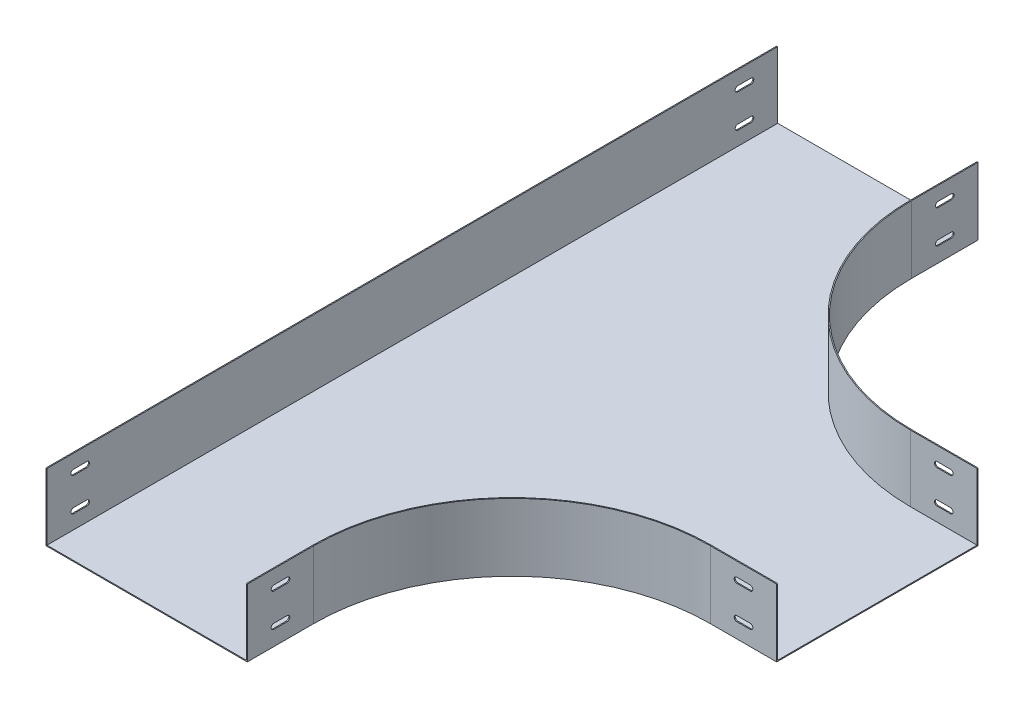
ISO-10303-21;
HEADER;
FILE_DESCRIPTION(('STEP AP214'),'2;1');
FILE_NAME('part.step','',(''),(''),'','','');
FILE_SCHEMA(('AUTOMOTIVE_DESIGN { 1 0 10303 214 1 1 1 1 }'));
ENDSEC;
DATA;
#1=APPLICATION_CONTEXT('core data for automotive mechanical design processes');
#2=APPLICATION_PROTOCOL_DEFINITION('international standard','automotive_design',2000,#1);
#3=PRODUCT_CONTEXT('',#1,'mechanical');
#4=PRODUCT('Part','Part','',(#3));
#5=PRODUCT_RELATED_PRODUCT_CATEGORY('part','',(#4));
#6=PRODUCT_DEFINITION_FORMATION('','',#4);
#7=PRODUCT_DEFINITION_CONTEXT('part definition',#1,'design');
#8=PRODUCT_DEFINITION('design','',#6,#7);
#9=PRODUCT_DEFINITION_SHAPE('','',#8);
#10=(LENGTH_UNIT() NAMED_UNIT(*) SI_UNIT(.MILLI.,.METRE.));
#11=(NAMED_UNIT(*) PLANE_ANGLE_UNIT() SI_UNIT($,.RADIAN.));
#12=(NAMED_UNIT(*) SI_UNIT($,.STERADIAN.) SOLID_ANGLE_UNIT());
#13=UNCERTAINTY_MEASURE_WITH_UNIT(LENGTH_MEASURE(1.E-05),#10,'distance_accuracy_value','');
#14=(GEOMETRIC_REPRESENTATION_CONTEXT(3) GLOBAL_UNCERTAINTY_ASSIGNED_CONTEXT((#13)) GLOBAL_UNIT_ASSIGNED_CONTEXT((#10,
#11,#12)) REPRESENTATION_CONTEXT('',''));
#15=CARTESIAN_POINT('',(0.,0.,0.));
#16=DIRECTION('',(0.,0.,1.));
#17=DIRECTION('',(1.,0.,0.));
#18=AXIS2_PLACEMENT_3D('',#15,#16,#17);
#19=CARTESIAN_POINT('',(-150.,-1.5,-550.));
#20=DIRECTION('',(0.,0.,-1.));
#21=DIRECTION('',(-1.,0.,0.));
#22=AXIS2_PLACEMENT_3D('',#19,#20,#21);
#23=PLANE('',#22);
#24=DIRECTION('',(-1.,0.,0.));
#25=VECTOR('',#24,1.);
#26=CARTESIAN_POINT('',(-150.,0.,-550.));
#27=LINE('',#26,#25);
#28=CARTESIAN_POINT('',(150.,0.,-550.));
#29=VERTEX_POINT('',#28);
#30=CARTESIAN_POINT('',(-150.,0.,-550.));
#31=VERTEX_POINT('',#30);
#32=EDGE_CURVE('E884',#29,#31,#27,.T.);
#33=ORIENTED_EDGE('',*,*,#32,.F.);
#34=DIRECTION('',(0.,-1.,0.));
#35=VECTOR('',#34,1.);
#36=CARTESIAN_POINT('',(150.,100.,-550.));
#37=LINE('',#36,#35);
#38=CARTESIAN_POINT('',(150.,100.,-550.));
#39=VERTEX_POINT('',#38);
#40=EDGE_CURVE('E800',#39,#29,#37,.T.);
#41=ORIENTED_EDGE('',*,*,#40,.F.);
#42=DIRECTION('',(1.,0.,0.));
#43=VECTOR('',#42,1.);
#44=CARTESIAN_POINT('',(150.,100.,-550.));
#45=LINE('',#44,#43);
#46=CARTESIAN_POINT('',(151.5,100.,-550.));
#47=VERTEX_POINT('',#46);
#48=EDGE_CURVE('E766',#39,#47,#45,.T.);
#49=ORIENTED_EDGE('',*,*,#48,.T.);
#50=DIRECTION('',(0.,-1.,0.));
#51=VECTOR('',#50,1.);
#52=CARTESIAN_POINT('',(151.5,100.,-550.));
#53=LINE('',#52,#51);
#54=CARTESIAN_POINT('',(151.5,-1.50000000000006,-550.));
#55=VERTEX_POINT('',#54);
#56=EDGE_CURVE('E802',#47,#55,#53,.T.);
#57=ORIENTED_EDGE('',*,*,#56,.T.);
#58=DIRECTION('',(-1.,0.,0.));
#59=VECTOR('',#58,1.);
#60=CARTESIAN_POINT('',(-150.,-1.5,-550.));
#61=LINE('',#60,#59);
#62=CARTESIAN_POINT('',(-151.5,-1.50000000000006,-550.));
#63=VERTEX_POINT('',#62);
#64=EDGE_CURVE('E886',#55,#63,#61,.T.);
#65=ORIENTED_EDGE('',*,*,#64,.T.);
#66=DIRECTION('',(0.,-1.,0.));
#67=VECTOR('',#66,1.);
#68=CARTESIAN_POINT('',(-151.5,100.,-550.));
#69=LINE('',#68,#67);
#70=CARTESIAN_POINT('',(-151.5,100.,-550.));
#71=VERTEX_POINT('',#70);
#72=EDGE_CURVE('E819',#71,#63,#69,.T.);
#73=ORIENTED_EDGE('',*,*,#72,.F.);
#74=DIRECTION('',(1.,0.,0.));
#75=VECTOR('',#74,1.);
#76=CARTESIAN_POINT('',(-151.5,100.,-550.));
#77=LINE('',#76,#75);
#78=CARTESIAN_POINT('',(-150.,100.,-550.));
#79=VERTEX_POINT('',#78);
#80=EDGE_CURVE('E816',#71,#79,#77,.T.);
#81=ORIENTED_EDGE('',*,*,#80,.T.);
#82=DIRECTION('',(0.,-1.,0.));
#83=VECTOR('',#82,1.);
#84=CARTESIAN_POINT('',(-150.,100.,-550.));
#85=LINE('',#84,#83);
#86=EDGE_CURVE('E822',#79,#31,#85,.T.);
#87=ORIENTED_EDGE('',*,*,#86,.T.);
#88=EDGE_LOOP('',(#33,#41,#49,#57,#65,#73,#81,#87));
#89=FACE_BOUND('',#88,.T.);
#90=ADVANCED_FACE('F32',(#89),#23,.T.);
#91=CARTESIAN_POINT('',(550.,-1.5,-150.));
#92=DIRECTION('',(1.,0.,0.));
#93=DIRECTION('',(0.,0.,-1.));
#94=AXIS2_PLACEMENT_3D('',#91,#92,#93);
#95=PLANE('',#94);
#96=DIRECTION('',(0.,0.,-1.));
#97=VECTOR('',#96,1.);
#98=CARTESIAN_POINT('',(550.,0.,-150.));
#99=LINE('',#98,#97);
#100=CARTESIAN_POINT('',(550.,0.,150.));
#101=VERTEX_POINT('',#100);
#102=CARTESIAN_POINT('',(550.,0.,-150.));
#103=VERTEX_POINT('',#102);
#104=EDGE_CURVE('E1209',#101,#103,#99,.T.);
#105=ORIENTED_EDGE('',*,*,#104,.F.);
#106=DIRECTION('',(0.,1.,0.));
#107=VECTOR('',#106,1.);
#108=CARTESIAN_POINT('',(550.,-1101.5010227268,150.));
#109=LINE('',#108,#107);
#110=CARTESIAN_POINT('',(550.,100.,150.));
#111=VERTEX_POINT('',#110);
#112=EDGE_CURVE('E877',#101,#111,#109,.T.);
#113=ORIENTED_EDGE('',*,*,#112,.T.);
#114=DIRECTION('',(0.,0.,1.));
#115=VECTOR('',#114,1.);
#116=CARTESIAN_POINT('',(550.,100.,150.));
#117=LINE('',#116,#115);
#118=CARTESIAN_POINT('',(550.,100.,151.5));
#119=VERTEX_POINT('',#118);
#120=EDGE_CURVE('E835',#111,#119,#117,.T.);
#121=ORIENTED_EDGE('',*,*,#120,.T.);
#122=DIRECTION('',(0.,1.,0.));
#123=VECTOR('',#122,1.);
#124=CARTESIAN_POINT('',(550.,-1101.5010227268,151.5));
#125=LINE('',#124,#123);
#126=CARTESIAN_POINT('',(550.,-1.50000000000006,151.5));
#127=VERTEX_POINT('',#126);
#128=EDGE_CURVE('E864',#127,#119,#125,.T.);
#129=ORIENTED_EDGE('',*,*,#128,.F.);
#130=DIRECTION('',(0.,0.,-1.));
#131=VECTOR('',#130,1.);
#132=CARTESIAN_POINT('',(550.,-1.5,-150.));
#133=LINE('',#132,#131);
#134=CARTESIAN_POINT('',(550.,-1.50000000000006,-151.5));
#135=VERTEX_POINT('',#134);
#136=EDGE_CURVE('E883',#127,#135,#133,.T.);
#137=ORIENTED_EDGE('',*,*,#136,.T.);
#138=DIRECTION('',(0.,-1.,0.));
#139=VECTOR('',#138,1.);
#140=CARTESIAN_POINT('',(550.,100.,-151.5));
#141=LINE('',#140,#139);
#142=CARTESIAN_POINT('',(550.,100.,-151.5));
#143=VERTEX_POINT('',#142);
#144=EDGE_CURVE('E789',#143,#135,#141,.T.);
#145=ORIENTED_EDGE('',*,*,#144,.F.);
#146=DIRECTION('',(0.,0.,1.));
#147=VECTOR('',#146,1.);
#148=CARTESIAN_POINT('',(550.,100.,-151.5));
#149=LINE('',#148,#147);
#150=CARTESIAN_POINT('',(550.,100.,-150.));
#151=VERTEX_POINT('',#150);
#152=EDGE_CURVE('E778',#143,#151,#149,.T.);
#153=ORIENTED_EDGE('',*,*,#152,.T.);
#154=DIRECTION('',(0.,-1.,0.));
#155=VECTOR('',#154,1.);
#156=CARTESIAN_POINT('',(550.,100.,-150.));
#157=LINE('',#156,#155);
#158=EDGE_CURVE('E792',#151,#103,#157,.T.);
#159=ORIENTED_EDGE('',*,*,#158,.T.);
#160=EDGE_LOOP('',(#105,#113,#121,#129,#137,#145,#153,#159));
#161=FACE_BOUND('',#160,.T.);
#162=ADVANCED_FACE('F987',(#161),#95,.T.);
#163=CARTESIAN_POINT('',(-150.,-1.5,550.));
#164=DIRECTION('',(0.,0.,1.));
#165=DIRECTION('',(1.,0.,0.));
#166=AXIS2_PLACEMENT_3D('',#163,#164,#165);
#167=PLANE('',#166);
#168=DIRECTION('',(1.,0.,0.));
#169=VECTOR('',#168,1.);
#170=CARTESIAN_POINT('',(-150.,0.,550.));
#171=LINE('',#170,#169);
#172=CARTESIAN_POINT('',(-150.,0.,550.));
#173=VERTEX_POINT('',#172);
#174=CARTESIAN_POINT('',(150.,0.,550.));
#175=VERTEX_POINT('',#174);
#176=EDGE_CURVE('E897',#173,#175,#171,.T.);
#177=ORIENTED_EDGE('',*,*,#176,.F.);
#178=DIRECTION('',(0.,-1.,0.));
#179=VECTOR('',#178,1.);
#180=CARTESIAN_POINT('',(-150.,100.,550.));
#181=LINE('',#180,#179);
#182=CARTESIAN_POINT('',(-150.,100.,550.));
#183=VERTEX_POINT('',#182);
#184=EDGE_CURVE('E831',#183,#173,#181,.T.);
#185=ORIENTED_EDGE('',*,*,#184,.F.);
#186=DIRECTION('',(-1.,0.,0.));
#187=VECTOR('',#186,1.);
#188=CARTESIAN_POINT('',(-150.,100.,550.));
#189=LINE('',#188,#187);
#190=CARTESIAN_POINT('',(-151.5,100.,550.));
#191=VERTEX_POINT('',#190);
#192=EDGE_CURVE('E810',#183,#191,#189,.T.);
#193=ORIENTED_EDGE('',*,*,#192,.T.);
#194=DIRECTION('',(0.,-1.,0.));
#195=VECTOR('',#194,1.);
#196=CARTESIAN_POINT('',(-151.5,100.,550.));
#197=LINE('',#196,#195);
#198=CARTESIAN_POINT('',(-151.5,-1.50000000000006,550.));
#199=VERTEX_POINT('',#198);
#200=EDGE_CURVE('E836',#191,#199,#197,.T.);
#201=ORIENTED_EDGE('',*,*,#200,.T.);
#202=DIRECTION('',(1.,0.,0.));
#203=VECTOR('',#202,1.);
#204=CARTESIAN_POINT('',(-150.,-1.5,550.));
#205=LINE('',#204,#203);
#206=CARTESIAN_POINT('',(151.5,-1.50000000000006,550.));
#207=VERTEX_POINT('',#206);
#208=EDGE_CURVE('E881',#199,#207,#205,.T.);
#209=ORIENTED_EDGE('',*,*,#208,.T.);
#210=DIRECTION('',(0.,1.,0.));
#211=VECTOR('',#210,1.);
#212=CARTESIAN_POINT('',(151.5,-1101.5010227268,550.));
#213=LINE('',#212,#211);
#214=CARTESIAN_POINT('',(151.5,100.,550.));
#215=VERTEX_POINT('',#214);
#216=EDGE_CURVE('E869',#207,#215,#213,.T.);
#217=ORIENTED_EDGE('',*,*,#216,.T.);
#218=DIRECTION('',(-1.,0.,0.));
#219=VECTOR('',#218,1.);
#220=CARTESIAN_POINT('',(151.5,100.,550.));
#221=LINE('',#220,#219);
#222=CARTESIAN_POINT('',(150.,100.,550.));
#223=VERTEX_POINT('',#222);
#224=EDGE_CURVE('E848',#215,#223,#221,.T.);
#225=ORIENTED_EDGE('',*,*,#224,.T.);
#226=DIRECTION('',(0.,1.,0.));
#227=VECTOR('',#226,1.);
#228=CARTESIAN_POINT('',(150.,-1101.5010227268,550.));
#229=LINE('',#228,#227);
#230=EDGE_CURVE('E871',#175,#223,#229,.T.);
#231=ORIENTED_EDGE('',*,*,#230,.F.);
#232=EDGE_LOOP('',(#177,#185,#193,#201,#209,#217,#225,#231));
#233=FACE_BOUND('',#232,.T.);
#234=ADVANCED_FACE('F34',(#233),#167,.T.);
#235=CARTESIAN_POINT('',(450.,-1.5,450.));
#236=DIRECTION('',(0.,-1.,0.));
#237=DIRECTION('',(0.,0.,-1.));
#238=AXIS2_PLACEMENT_3D('',#235,#236,#237);
#239=PLANE('',#238);
#240=ORIENTED_EDGE('',*,*,#64,.F.);
#241=DIRECTION('',(0.,0.,-1.));
#242=VECTOR('',#241,1.);
#243=CARTESIAN_POINT('',(151.5,-1.50000000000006,-450.));
#244=LINE('',#243,#242);
#245=CARTESIAN_POINT('',(151.5,-1.50000000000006,-450.));
#246=VERTEX_POINT('',#245);
#247=EDGE_CURVE('E755',#246,#55,#244,.T.);
#248=ORIENTED_EDGE('',*,*,#247,.F.);
#249=CARTESIAN_POINT('',(450.,-1.50000000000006,-450.));
#250=DIRECTION('',(0.,-1.,0.));
#251=DIRECTION('',(0.,0.,-1.));
#252=AXIS2_PLACEMENT_3D('',#249,#250,#251);
#253=CIRCLE('',#252,298.5);
#254=CARTESIAN_POINT('',(450.,-1.50000000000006,-151.5));
#255=VERTEX_POINT('',#254);
#256=EDGE_CURVE('E760',#255,#246,#253,.T.);
#257=ORIENTED_EDGE('',*,*,#256,.F.);
#258=DIRECTION('',(-1.,0.,0.));
#259=VECTOR('',#258,1.);
#260=CARTESIAN_POINT('',(550.,-1.50000000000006,-151.5));
#261=LINE('',#260,#259);
#262=EDGE_CURVE('E756',#135,#255,#261,.T.);
#263=ORIENTED_EDGE('',*,*,#262,.F.);
#264=ORIENTED_EDGE('',*,*,#136,.F.);
#265=DIRECTION('',(1.,0.,0.));
#266=VECTOR('',#265,1.);
#267=CARTESIAN_POINT('',(450.,-1.50000000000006,151.5));
#268=LINE('',#267,#266);
#269=CARTESIAN_POINT('',(450.,-1.50000000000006,151.5));
#270=VERTEX_POINT('',#269);
#271=EDGE_CURVE('E857',#270,#127,#268,.T.);
#272=ORIENTED_EDGE('',*,*,#271,.F.);
#273=CARTESIAN_POINT('',(450.,-1.50000000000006,450.));
#274=DIRECTION('',(0.,-1.,0.));
#275=DIRECTION('',(0.,0.,-1.));
#276=AXIS2_PLACEMENT_3D('',#273,#274,#275);
#277=CIRCLE('',#276,298.5);
#278=CARTESIAN_POINT('',(151.5,-1.50000000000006,450.));
#279=VERTEX_POINT('',#278);
#280=EDGE_CURVE('E862',#279,#270,#277,.T.);
#281=ORIENTED_EDGE('',*,*,#280,.F.);
#282=DIRECTION('',(0.,0.,-1.));
#283=VECTOR('',#282,1.);
#284=CARTESIAN_POINT('',(151.5,-1.50000000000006,550.));
#285=LINE('',#284,#283);
#286=EDGE_CURVE('E858',#207,#279,#285,.T.);
#287=ORIENTED_EDGE('',*,*,#286,.F.);
#288=ORIENTED_EDGE('',*,*,#208,.F.);
#289=DIRECTION('',(0.,0.,1.));
#290=VECTOR('',#289,1.);
#291=CARTESIAN_POINT('',(-151.5,-1.50000000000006,-550.));
#292=LINE('',#291,#290);
#293=EDGE_CURVE('E805',#63,#199,#292,.T.);
#294=ORIENTED_EDGE('',*,*,#293,.F.);
#295=EDGE_LOOP('',(#240,#248,#257,#263,#264,#272,#281,#287,#288,#294));
#296=FACE_BOUND('',#295,.T.);
#297=ADVANCED_FACE('F1000',(#296),#239,.T.);
#298=CARTESIAN_POINT('',(450.,0.,450.));
#299=DIRECTION('',(0.,-1.,0.));
#300=DIRECTION('',(0.,0.,-1.));
#301=AXIS2_PLACEMENT_3D('',#298,#299,#300);
#302=PLANE('',#301);
#303=DIRECTION('',(0.,0.,1.));
#304=VECTOR('',#303,1.);
#305=CARTESIAN_POINT('',(-150.,0.,-550.));
#306=LINE('',#305,#304);
#307=EDGE_CURVE('E879',#31,#173,#306,.T.);
#308=ORIENTED_EDGE('',*,*,#307,.T.);
#309=ORIENTED_EDGE('',*,*,#176,.T.);
#310=DIRECTION('',(0.,0.,-1.));
#311=VECTOR('',#310,1.);
#312=CARTESIAN_POINT('',(150.,0.,550.));
#313=LINE('',#312,#311);
#314=CARTESIAN_POINT('',(150.,0.,450.));
#315=VERTEX_POINT('',#314);
#316=EDGE_CURVE('E891',#175,#315,#313,.T.);
#317=ORIENTED_EDGE('',*,*,#316,.T.);
#318=CARTESIAN_POINT('',(450.,0.,450.));
#319=DIRECTION('',(0.,-1.,0.));
#320=DIRECTION('',(0.,0.,-1.));
#321=AXIS2_PLACEMENT_3D('',#318,#319,#320);
#322=CIRCLE('',#321,300.);
#323=CARTESIAN_POINT('',(450.,0.,150.));
#324=VERTEX_POINT('',#323);
#325=EDGE_CURVE('E1205',#315,#324,#322,.T.);
#326=ORIENTED_EDGE('',*,*,#325,.T.);
#327=DIRECTION('',(1.,0.,0.));
#328=VECTOR('',#327,1.);
#329=CARTESIAN_POINT('',(550.,0.,150.));
#330=LINE('',#329,#328);
#331=EDGE_CURVE('E1207',#324,#101,#330,.T.);
#332=ORIENTED_EDGE('',*,*,#331,.T.);
#333=ORIENTED_EDGE('',*,*,#104,.T.);
#334=DIRECTION('',(-1.,0.,0.));
#335=VECTOR('',#334,1.);
#336=CARTESIAN_POINT('',(550.,0.,-150.));
#337=LINE('',#336,#335);
#338=CARTESIAN_POINT('',(450.,0.,-150.));
#339=VERTEX_POINT('',#338);
#340=EDGE_CURVE('E1201',#103,#339,#337,.T.);
#341=ORIENTED_EDGE('',*,*,#340,.T.);
#342=CARTESIAN_POINT('',(450.,0.,-450.));
#343=DIRECTION('',(0.,-1.,0.));
#344=DIRECTION('',(0.,0.,1.));
#345=AXIS2_PLACEMENT_3D('',#342,#343,#344);
#346=CIRCLE('',#345,300.);
#347=CARTESIAN_POINT('',(150.,0.,-450.));
#348=VERTEX_POINT('',#347);
#349=EDGE_CURVE('E1198',#339,#348,#346,.T.);
#350=ORIENTED_EDGE('',*,*,#349,.T.);
#351=DIRECTION('',(0.,0.,-1.));
#352=VECTOR('',#351,1.);
#353=CARTESIAN_POINT('',(150.,0.,-550.));
#354=LINE('',#353,#352);
#355=EDGE_CURVE('E902',#348,#29,#354,.T.);
#356=ORIENTED_EDGE('',*,*,#355,.T.);
#357=ORIENTED_EDGE('',*,*,#32,.T.);
#358=EDGE_LOOP('',(#308,#309,#317,#326,#332,#333,#341,#350,#356,#357));
#359=FACE_BOUND('',#358,.T.);
#360=ADVANCED_FACE('F996',(#359),#302,.F.);
#361=CARTESIAN_POINT('',(150.,-1101.5010227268,550.));
#362=DIRECTION('',(1.,0.,0.));
#363=DIRECTION('',(0.,0.,-1.));
#364=AXIS2_PLACEMENT_3D('',#361,#362,#363);
#365=PLANE('',#364);
#366=DIRECTION('',(0.,0.,1.));
#367=VECTOR('',#366,1.);
#368=CARTESIAN_POINT('',(150.,28.9999999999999,550.));
#369=LINE('',#368,#367);
#370=CARTESIAN_POINT('',(150.,29.,490.000000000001));
#371=VERTEX_POINT('',#370);
#372=CARTESIAN_POINT('',(150.,29.,510.000000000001));
#373=VERTEX_POINT('',#372);
#374=EDGE_CURVE('E596',#371,#373,#369,.T.);
#375=ORIENTED_EDGE('',*,*,#374,.T.);
#376=CARTESIAN_POINT('',(150.,25.,510.000000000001));
#377=DIRECTION('',(1.,0.,0.));
#378=DIRECTION('',(0.,0.,-1.));
#379=AXIS2_PLACEMENT_3D('',#376,#377,#378);
#380=CIRCLE('',#379,4.);
#381=CARTESIAN_POINT('',(150.,21.,510.000000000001));
#382=VERTEX_POINT('',#381);
#383=EDGE_CURVE('E605',#373,#382,#380,.T.);
#384=ORIENTED_EDGE('',*,*,#383,.T.);
#385=DIRECTION('',(0.,0.,-1.));
#386=VECTOR('',#385,1.);
#387=CARTESIAN_POINT('',(150.,20.9999999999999,550.));
#388=LINE('',#387,#386);
#389=CARTESIAN_POINT('',(150.,20.9999999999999,490.000000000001));
#390=VERTEX_POINT('',#389);
#391=EDGE_CURVE('E582',#382,#390,#388,.T.);
#392=ORIENTED_EDGE('',*,*,#391,.T.);
#393=CARTESIAN_POINT('',(150.,25.,490.000000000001));
#394=DIRECTION('',(1.,0.,0.));
#395=DIRECTION('',(0.,0.,-1.));
#396=AXIS2_PLACEMENT_3D('',#393,#394,#395);
#397=CIRCLE('',#396,4.);
#398=EDGE_CURVE('E589',#390,#371,#397,.T.);
#399=ORIENTED_EDGE('',*,*,#398,.T.);
#400=EDGE_LOOP('',(#375,#384,#392,#399));
#401=FACE_BOUND('',#400,.T.);
#402=DIRECTION('',(0.,0.,1.));
#403=VECTOR('',#402,1.);
#404=CARTESIAN_POINT('',(150.,79.,550.));
#405=LINE('',#404,#403);
#406=CARTESIAN_POINT('',(150.,79.,490.000000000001));
#407=VERTEX_POINT('',#406);
#408=CARTESIAN_POINT('',(150.,79.,510.000000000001));
#409=VERTEX_POINT('',#408);
#410=EDGE_CURVE('E653',#407,#409,#405,.T.);
#411=ORIENTED_EDGE('',*,*,#410,.T.);
#412=CARTESIAN_POINT('',(150.,75.,510.000000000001));
#413=DIRECTION('',(1.,0.,0.));
#414=DIRECTION('',(0.,0.,-1.));
#415=AXIS2_PLACEMENT_3D('',#412,#413,#414);
#416=CIRCLE('',#415,4.);
#417=CARTESIAN_POINT('',(150.,71.,510.000000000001));
#418=VERTEX_POINT('',#417);
#419=EDGE_CURVE('E662',#409,#418,#416,.T.);
#420=ORIENTED_EDGE('',*,*,#419,.T.);
#421=DIRECTION('',(0.,0.,-1.));
#422=VECTOR('',#421,1.);
#423=CARTESIAN_POINT('',(150.,71.,550.));
#424=LINE('',#423,#422);
#425=CARTESIAN_POINT('',(150.,71.,490.000000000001));
#426=VERTEX_POINT('',#425);
#427=EDGE_CURVE('E639',#418,#426,#424,.T.);
#428=ORIENTED_EDGE('',*,*,#427,.T.);
#429=CARTESIAN_POINT('',(150.,75.,490.000000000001));
#430=DIRECTION('',(1.,0.,0.));
#431=DIRECTION('',(0.,0.,-1.));
#432=AXIS2_PLACEMENT_3D('',#429,#430,#431);
#433=CIRCLE('',#432,4.);
#434=EDGE_CURVE('E646',#426,#407,#433,.T.);
#435=ORIENTED_EDGE('',*,*,#434,.T.);
#436=EDGE_LOOP('',(#411,#420,#428,#435));
#437=FACE_BOUND('',#436,.T.);
#438=DIRECTION('',(0.,1.,0.));
#439=VECTOR('',#438,1.);
#440=CARTESIAN_POINT('',(150.,-1101.5010227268,450.));
#441=LINE('',#440,#439);
#442=CARTESIAN_POINT('',(150.,100.,450.));
#443=VERTEX_POINT('',#442);
#444=EDGE_CURVE('E873',#315,#443,#441,.T.);
#445=ORIENTED_EDGE('',*,*,#444,.F.);
#446=ORIENTED_EDGE('',*,*,#316,.F.);
#447=ORIENTED_EDGE('',*,*,#230,.T.);
#448=DIRECTION('',(0.,0.,-1.));
#449=VECTOR('',#448,1.);
#450=CARTESIAN_POINT('',(150.,100.,550.));
#451=LINE('',#450,#449);
#452=EDGE_CURVE('E845',#223,#443,#451,.T.);
#453=ORIENTED_EDGE('',*,*,#452,.T.);
#454=EDGE_LOOP('',(#445,#446,#447,#453));
#455=FACE_BOUND('',#454,.T.);
#456=ADVANCED_FACE('F999',(#401,#437,#455),#365,.F.);
#457=CARTESIAN_POINT('',(450.,-1101.5010227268,450.));
#458=DIRECTION('',(0.,1.,0.));
#459=DIRECTION('',(0.,0.,1.));
#460=AXIS2_PLACEMENT_3D('',#457,#458,#459);
#461=CYLINDRICAL_SURFACE('',#460,300.);
#462=DIRECTION('',(0.,1.,0.));
#463=VECTOR('',#462,1.);
#464=CARTESIAN_POINT('',(450.,-1101.5010227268,150.));
#465=LINE('',#464,#463);
#466=CARTESIAN_POINT('',(450.,100.,150.));
#467=VERTEX_POINT('',#466);
#468=EDGE_CURVE('E875',#324,#467,#465,.T.);
#469=ORIENTED_EDGE('',*,*,#468,.F.);
#470=ORIENTED_EDGE('',*,*,#325,.F.);
#471=ORIENTED_EDGE('',*,*,#444,.T.);
#472=CARTESIAN_POINT('',(450.,100.,450.));
#473=DIRECTION('',(0.,-1.,0.));
#474=DIRECTION('',(0.,0.,1.));
#475=AXIS2_PLACEMENT_3D('',#472,#473,#474);
#476=CIRCLE('',#475,300.);
#477=EDGE_CURVE('E842',#443,#467,#476,.T.);
#478=ORIENTED_EDGE('',*,*,#477,.T.);
#479=EDGE_LOOP('',(#469,#470,#471,#478));
#480=FACE_BOUND('',#479,.T.);
#481=ADVANCED_FACE('F1021',(#480),#461,.T.);
#482=CARTESIAN_POINT('',(450.,-1101.5010227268,150.));
#483=DIRECTION('',(0.,0.,1.));
#484=DIRECTION('',(1.,0.,0.));
#485=AXIS2_PLACEMENT_3D('',#482,#483,#484);
#486=PLANE('',#485);
#487=DIRECTION('',(-1.,0.,0.));
#488=VECTOR('',#487,1.);
#489=CARTESIAN_POINT('',(450.,28.9999999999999,150.));
#490=LINE('',#489,#488);
#491=CARTESIAN_POINT('',(510.,29.,150.));
#492=VERTEX_POINT('',#491);
#493=CARTESIAN_POINT('',(490.,29.,150.));
#494=VERTEX_POINT('',#493);
#495=EDGE_CURVE('E698',#492,#494,#490,.T.);
#496=ORIENTED_EDGE('',*,*,#495,.T.);
#497=CARTESIAN_POINT('',(490.,25.,150.));
#498=DIRECTION('',(0.,0.,1.));
#499=DIRECTION('',(1.,0.,0.));
#500=AXIS2_PLACEMENT_3D('',#497,#498,#499);
#501=CIRCLE('',#500,4.);
#502=CARTESIAN_POINT('',(490.,21.,150.));
#503=VERTEX_POINT('',#502);
#504=EDGE_CURVE('E707',#494,#503,#501,.T.);
#505=ORIENTED_EDGE('',*,*,#504,.T.);
#506=DIRECTION('',(1.,0.,0.));
#507=VECTOR('',#506,1.);
#508=CARTESIAN_POINT('',(450.,20.9999999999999,150.));
#509=LINE('',#508,#507);
#510=CARTESIAN_POINT('',(510.,20.9999999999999,150.));
#511=VERTEX_POINT('',#510);
#512=EDGE_CURVE('E684',#503,#511,#509,.T.);
#513=ORIENTED_EDGE('',*,*,#512,.T.);
#514=CARTESIAN_POINT('',(510.,25.,150.));
#515=DIRECTION('',(0.,0.,1.));
#516=DIRECTION('',(1.,0.,0.));
#517=AXIS2_PLACEMENT_3D('',#514,#515,#516);
#518=CIRCLE('',#517,4.);
#519=EDGE_CURVE('E691',#511,#492,#518,.T.);
#520=ORIENTED_EDGE('',*,*,#519,.T.);
#521=EDGE_LOOP('',(#496,#505,#513,#520));
#522=FACE_BOUND('',#521,.T.);
#523=DIRECTION('',(-1.,0.,0.));
#524=VECTOR('',#523,1.);
#525=CARTESIAN_POINT('',(450.,79.,150.));
#526=LINE('',#525,#524);
#527=CARTESIAN_POINT('',(510.,79.,150.));
#528=VERTEX_POINT('',#527);
#529=CARTESIAN_POINT('',(490.,79.,150.));
#530=VERTEX_POINT('',#529);
#531=EDGE_CURVE('E743',#528,#530,#526,.T.);
#532=ORIENTED_EDGE('',*,*,#531,.T.);
#533=CARTESIAN_POINT('',(490.,75.,150.));
#534=DIRECTION('',(0.,0.,1.));
#535=DIRECTION('',(1.,0.,0.));
#536=AXIS2_PLACEMENT_3D('',#533,#534,#535);
#537=CIRCLE('',#536,4.);
#538=CARTESIAN_POINT('',(490.,71.,150.));
#539=VERTEX_POINT('',#538);
#540=EDGE_CURVE('E752',#530,#539,#537,.T.);
#541=ORIENTED_EDGE('',*,*,#540,.T.);
#542=DIRECTION('',(1.,0.,0.));
#543=VECTOR('',#542,1.);
#544=CARTESIAN_POINT('',(450.,71.,150.));
#545=LINE('',#544,#543);
#546=CARTESIAN_POINT('',(510.,71.,150.));
#547=VERTEX_POINT('',#546);
#548=EDGE_CURVE('E729',#539,#547,#545,.T.);
#549=ORIENTED_EDGE('',*,*,#548,.T.);
#550=CARTESIAN_POINT('',(510.,75.,150.));
#551=DIRECTION('',(0.,0.,1.));
#552=DIRECTION('',(1.,0.,0.));
#553=AXIS2_PLACEMENT_3D('',#550,#551,#552);
#554=CIRCLE('',#553,4.);
#555=EDGE_CURVE('E736',#547,#528,#554,.T.);
#556=ORIENTED_EDGE('',*,*,#555,.T.);
#557=EDGE_LOOP('',(#532,#541,#549,#556));
#558=FACE_BOUND('',#557,.T.);
#559=ORIENTED_EDGE('',*,*,#112,.F.);
#560=ORIENTED_EDGE('',*,*,#331,.F.);
#561=ORIENTED_EDGE('',*,*,#468,.T.);
#562=DIRECTION('',(1.,0.,0.));
#563=VECTOR('',#562,1.);
#564=CARTESIAN_POINT('',(450.,100.,150.));
#565=LINE('',#564,#563);
#566=EDGE_CURVE('E839',#467,#111,#565,.T.);
#567=ORIENTED_EDGE('',*,*,#566,.T.);
#568=EDGE_LOOP('',(#559,#560,#561,#567));
#569=FACE_BOUND('',#568,.T.);
#570=ADVANCED_FACE('F1009',(#522,#558,#569),#486,.F.);
#571=CARTESIAN_POINT('',(450.,-1101.5010227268,151.5));
#572=DIRECTION('',(0.,0.,1.));
#573=DIRECTION('',(1.,0.,0.));
#574=AXIS2_PLACEMENT_3D('',#571,#572,#573);
#575=PLANE('',#574);
#576=CARTESIAN_POINT('',(490.,25.,151.5));
#577=DIRECTION('',(0.,0.,1.));
#578=DIRECTION('',(1.,0.,0.));
#579=AXIS2_PLACEMENT_3D('',#576,#577,#578);
#580=CIRCLE('',#579,4.);
#581=CARTESIAN_POINT('',(490.,29.,151.5));
#582=VERTEX_POINT('',#581);
#583=CARTESIAN_POINT('',(490.,20.9999999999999,151.5));
#584=VERTEX_POINT('',#583);
#585=EDGE_CURVE('E704',#582,#584,#580,.T.);
#586=ORIENTED_EDGE('',*,*,#585,.F.);
#587=DIRECTION('',(-1.,0.,0.));
#588=VECTOR('',#587,1.);
#589=CARTESIAN_POINT('',(450.,28.9999999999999,151.5));
#590=LINE('',#589,#588);
#591=CARTESIAN_POINT('',(510.,29.,151.5));
#592=VERTEX_POINT('',#591);
#593=EDGE_CURVE('E696',#592,#582,#590,.T.);
#594=ORIENTED_EDGE('',*,*,#593,.F.);
#595=CARTESIAN_POINT('',(510.,25.,151.5));
#596=DIRECTION('',(0.,0.,1.));
#597=DIRECTION('',(1.,0.,0.));
#598=AXIS2_PLACEMENT_3D('',#595,#596,#597);
#599=CIRCLE('',#598,4.);
#600=CARTESIAN_POINT('',(510.,21.,151.5));
#601=VERTEX_POINT('',#600);
#602=EDGE_CURVE('E689',#601,#592,#599,.T.);
#603=ORIENTED_EDGE('',*,*,#602,.F.);
#604=DIRECTION('',(1.,0.,0.));
#605=VECTOR('',#604,1.);
#606=CARTESIAN_POINT('',(450.,20.9999999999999,151.5));
#607=LINE('',#606,#605);
#608=EDGE_CURVE('E682',#584,#601,#607,.T.);
#609=ORIENTED_EDGE('',*,*,#608,.F.);
#610=EDGE_LOOP('',(#586,#594,#603,#609));
#611=FACE_BOUND('',#610,.T.);
#612=CARTESIAN_POINT('',(490.,75.,151.5));
#613=DIRECTION('',(0.,0.,1.));
#614=DIRECTION('',(1.,0.,0.));
#615=AXIS2_PLACEMENT_3D('',#612,#613,#614);
#616=CIRCLE('',#615,4.);
#617=CARTESIAN_POINT('',(490.,79.,151.5));
#618=VERTEX_POINT('',#617);
#619=CARTESIAN_POINT('',(490.,71.,151.5));
#620=VERTEX_POINT('',#619);
#621=EDGE_CURVE('E749',#618,#620,#616,.T.);
#622=ORIENTED_EDGE('',*,*,#621,.F.);
#623=DIRECTION('',(-1.,0.,0.));
#624=VECTOR('',#623,1.);
#625=CARTESIAN_POINT('',(450.,79.,151.5));
#626=LINE('',#625,#624);
#627=CARTESIAN_POINT('',(510.,79.,151.5));
#628=VERTEX_POINT('',#627);
#629=EDGE_CURVE('E741',#628,#618,#626,.T.);
#630=ORIENTED_EDGE('',*,*,#629,.F.);
#631=CARTESIAN_POINT('',(510.,75.,151.5));
#632=DIRECTION('',(0.,0.,1.));
#633=DIRECTION('',(1.,0.,0.));
#634=AXIS2_PLACEMENT_3D('',#631,#632,#633);
#635=CIRCLE('',#634,4.);
#636=CARTESIAN_POINT('',(510.,71.,151.5));
#637=VERTEX_POINT('',#636);
#638=EDGE_CURVE('E734',#637,#628,#635,.T.);
#639=ORIENTED_EDGE('',*,*,#638,.F.);
#640=DIRECTION('',(1.,0.,0.));
#641=VECTOR('',#640,1.);
#642=CARTESIAN_POINT('',(450.,71.,151.5));
#643=LINE('',#642,#641);
#644=EDGE_CURVE('E727',#620,#637,#643,.T.);
#645=ORIENTED_EDGE('',*,*,#644,.F.);
#646=EDGE_LOOP('',(#622,#630,#639,#645));
#647=FACE_BOUND('',#646,.T.);
#648=ORIENTED_EDGE('',*,*,#128,.T.);
#649=DIRECTION('',(1.,0.,0.));
#650=VECTOR('',#649,1.);
#651=CARTESIAN_POINT('',(450.,100.,151.5));
#652=LINE('',#651,#650);
#653=CARTESIAN_POINT('',(450.,100.,151.5));
#654=VERTEX_POINT('',#653);
#655=EDGE_CURVE('E832',#654,#119,#652,.T.);
#656=ORIENTED_EDGE('',*,*,#655,.F.);
#657=DIRECTION('',(0.,1.,0.));
#658=VECTOR('',#657,1.);
#659=CARTESIAN_POINT('',(450.,-1101.5010227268,151.5));
#660=LINE('',#659,#658);
#661=EDGE_CURVE('E861',#270,#654,#660,.T.);
#662=ORIENTED_EDGE('',*,*,#661,.F.);
#663=ORIENTED_EDGE('',*,*,#271,.T.);
#664=EDGE_LOOP('',(#648,#656,#662,#663));
#665=FACE_BOUND('',#664,.T.);
#666=ADVANCED_FACE('F1005',(#611,#647,#665),#575,.T.);
#667=CARTESIAN_POINT('',(450.,-1101.5010227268,450.));
#668=DIRECTION('',(0.,1.,0.));
#669=DIRECTION('',(0.,0.,1.));
#670=AXIS2_PLACEMENT_3D('',#667,#668,#669);
#671=CYLINDRICAL_SURFACE('',#670,298.5);
#672=ORIENTED_EDGE('',*,*,#661,.T.);
#673=CARTESIAN_POINT('',(450.,100.,450.));
#674=DIRECTION('',(0.,1.,0.));
#675=DIRECTION('',(1.,0.,0.));
#676=AXIS2_PLACEMENT_3D('',#673,#674,#675);
#677=CIRCLE('',#676,298.5);
#678=CARTESIAN_POINT('',(151.5,100.,450.));
#679=VERTEX_POINT('',#678);
#680=EDGE_CURVE('E854',#679,#654,#677,.F.);
#681=ORIENTED_EDGE('',*,*,#680,.F.);
#682=DIRECTION('',(0.,1.,0.));
#683=VECTOR('',#682,1.);
#684=CARTESIAN_POINT('',(151.5,-1101.5010227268,450.));
#685=LINE('',#684,#683);
#686=EDGE_CURVE('E860',#279,#679,#685,.T.);
#687=ORIENTED_EDGE('',*,*,#686,.F.);
#688=ORIENTED_EDGE('',*,*,#280,.T.);
#689=EDGE_LOOP('',(#672,#681,#687,#688));
#690=FACE_BOUND('',#689,.T.);
#691=ADVANCED_FACE('F1008',(#690),#671,.F.);
#692=CARTESIAN_POINT('',(151.5,-1101.5010227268,550.));
#693=DIRECTION('',(1.,0.,0.));
#694=DIRECTION('',(0.,0.,-1.));
#695=AXIS2_PLACEMENT_3D('',#692,#693,#694);
#696=PLANE('',#695);
#697=CARTESIAN_POINT('',(151.5,25.,510.000000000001));
#698=DIRECTION('',(1.,0.,0.));
#699=DIRECTION('',(0.,0.,-1.));
#700=AXIS2_PLACEMENT_3D('',#697,#698,#699);
#701=CIRCLE('',#700,4.);
#702=CARTESIAN_POINT('',(151.5,29.,510.000000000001));
#703=VERTEX_POINT('',#702);
#704=CARTESIAN_POINT('',(151.5,20.9999999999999,510.000000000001));
#705=VERTEX_POINT('',#704);
#706=EDGE_CURVE('E602',#703,#705,#701,.T.);
#707=ORIENTED_EDGE('',*,*,#706,.F.);
#708=DIRECTION('',(0.,0.,1.));
#709=VECTOR('',#708,1.);
#710=CARTESIAN_POINT('',(151.5,28.9999999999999,550.));
#711=LINE('',#710,#709);
#712=CARTESIAN_POINT('',(151.5,29.,490.000000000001));
#713=VERTEX_POINT('',#712);
#714=EDGE_CURVE('E594',#713,#703,#711,.T.);
#715=ORIENTED_EDGE('',*,*,#714,.F.);
#716=CARTESIAN_POINT('',(151.5,25.,490.000000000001));
#717=DIRECTION('',(1.,0.,0.));
#718=DIRECTION('',(0.,0.,-1.));
#719=AXIS2_PLACEMENT_3D('',#716,#717,#718);
#720=CIRCLE('',#719,4.);
#721=CARTESIAN_POINT('',(151.5,21.,490.000000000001));
#722=VERTEX_POINT('',#721);
#723=EDGE_CURVE('E587',#722,#713,#720,.T.);
#724=ORIENTED_EDGE('',*,*,#723,.F.);
#725=DIRECTION('',(0.,0.,-1.));
#726=VECTOR('',#725,1.);
#727=CARTESIAN_POINT('',(151.5,20.9999999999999,550.));
#728=LINE('',#727,#726);
#729=EDGE_CURVE('E580',#705,#722,#728,.T.);
#730=ORIENTED_EDGE('',*,*,#729,.F.);
#731=EDGE_LOOP('',(#707,#715,#724,#730));
#732=FACE_BOUND('',#731,.T.);
#733=CARTESIAN_POINT('',(151.5,75.,510.000000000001));
#734=DIRECTION('',(1.,0.,0.));
#735=DIRECTION('',(0.,0.,-1.));
#736=AXIS2_PLACEMENT_3D('',#733,#734,#735);
#737=CIRCLE('',#736,4.);
#738=CARTESIAN_POINT('',(151.5,79.,510.000000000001));
#739=VERTEX_POINT('',#738);
#740=CARTESIAN_POINT('',(151.5,71.,510.000000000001));
#741=VERTEX_POINT('',#740);
#742=EDGE_CURVE('E659',#739,#741,#737,.T.);
#743=ORIENTED_EDGE('',*,*,#742,.F.);
#744=DIRECTION('',(0.,0.,1.));
#745=VECTOR('',#744,1.);
#746=CARTESIAN_POINT('',(151.5,79.,550.));
#747=LINE('',#746,#745);
#748=CARTESIAN_POINT('',(151.5,79.,490.000000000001));
#749=VERTEX_POINT('',#748);
#750=EDGE_CURVE('E651',#749,#739,#747,.T.);
#751=ORIENTED_EDGE('',*,*,#750,.F.);
#752=CARTESIAN_POINT('',(151.5,75.,490.000000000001));
#753=DIRECTION('',(1.,0.,0.));
#754=DIRECTION('',(0.,0.,-1.));
#755=AXIS2_PLACEMENT_3D('',#752,#753,#754);
#756=CIRCLE('',#755,4.);
#757=CARTESIAN_POINT('',(151.5,71.,490.000000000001));
#758=VERTEX_POINT('',#757);
#759=EDGE_CURVE('E644',#758,#749,#756,.T.);
#760=ORIENTED_EDGE('',*,*,#759,.F.);
#761=DIRECTION('',(0.,0.,-1.));
#762=VECTOR('',#761,1.);
#763=CARTESIAN_POINT('',(151.5,71.,550.));
#764=LINE('',#763,#762);
#765=EDGE_CURVE('E637',#741,#758,#764,.T.);
#766=ORIENTED_EDGE('',*,*,#765,.F.);
#767=EDGE_LOOP('',(#743,#751,#760,#766));
#768=FACE_BOUND('',#767,.T.);
#769=ORIENTED_EDGE('',*,*,#686,.T.);
#770=DIRECTION('',(0.,0.,-1.));
#771=VECTOR('',#770,1.);
#772=CARTESIAN_POINT('',(151.5,100.,550.));
#773=LINE('',#772,#771);
#774=EDGE_CURVE('E851',#215,#679,#773,.T.);
#775=ORIENTED_EDGE('',*,*,#774,.F.);
#776=ORIENTED_EDGE('',*,*,#216,.F.);
#777=ORIENTED_EDGE('',*,*,#286,.T.);
#778=EDGE_LOOP('',(#769,#775,#776,#777));
#779=FACE_BOUND('',#778,.T.);
#780=ADVANCED_FACE('F1013',(#732,#768,#779),#696,.T.);
#781=CARTESIAN_POINT('',(450.,100.,450.));
#782=DIRECTION('',(0.,-1.,0.));
#783=DIRECTION('',(-1.,0.,0.));
#784=AXIS2_PLACEMENT_3D('',#781,#782,#783);
#785=PLANE('',#784);
#786=ORIENTED_EDGE('',*,*,#655,.T.);
#787=ORIENTED_EDGE('',*,*,#120,.F.);
#788=ORIENTED_EDGE('',*,*,#566,.F.);
#789=ORIENTED_EDGE('',*,*,#477,.F.);
#790=ORIENTED_EDGE('',*,*,#452,.F.);
#791=ORIENTED_EDGE('',*,*,#224,.F.);
#792=ORIENTED_EDGE('',*,*,#774,.T.);
#793=ORIENTED_EDGE('',*,*,#680,.T.);
#794=EDGE_LOOP('',(#786,#787,#788,#789,#790,#791,#792,#793));
#795=FACE_BOUND('',#794,.T.);
#796=ADVANCED_FACE('F1017',(#795),#785,.F.);
#797=CARTESIAN_POINT('',(-150.,100.,-550.));
#798=DIRECTION('',(1.,0.,0.));
#799=DIRECTION('',(0.,0.,-1.));
#800=AXIS2_PLACEMENT_3D('',#797,#798,#799);
#801=PLANE('',#800);
#802=CARTESIAN_POINT('',(-150.,25.,-490.));
#803=DIRECTION('',(1.,0.,0.));
#804=DIRECTION('',(0.,0.,-1.));
#805=AXIS2_PLACEMENT_3D('',#802,#803,#804);
#806=CIRCLE('',#805,4.);
#807=CARTESIAN_POINT('',(-150.,29.,-490.));
#808=VERTEX_POINT('',#807);
#809=CARTESIAN_POINT('',(-150.,21.,-490.));
#810=VERTEX_POINT('',#809);
#811=EDGE_CURVE('E463',#808,#810,#806,.T.);
#812=ORIENTED_EDGE('',*,*,#811,.F.);
#813=DIRECTION('',(0.,0.,1.));
#814=VECTOR('',#813,1.);
#815=CARTESIAN_POINT('',(-150.,29.,-550.));
#816=LINE('',#815,#814);
#817=CARTESIAN_POINT('',(-150.,29.,-510.));
#818=VERTEX_POINT('',#817);
#819=EDGE_CURVE('E501',#818,#808,#816,.T.);
#820=ORIENTED_EDGE('',*,*,#819,.F.);
#821=CARTESIAN_POINT('',(-150.,25.,-510.));
#822=DIRECTION('',(1.,0.,0.));
#823=DIRECTION('',(0.,0.,-1.));
#824=AXIS2_PLACEMENT_3D('',#821,#822,#823);
#825=CIRCLE('',#824,4.);
#826=CARTESIAN_POINT('',(-150.,21.,-510.));
#827=VERTEX_POINT('',#826);
#828=EDGE_CURVE('E497',#827,#818,#825,.T.);
#829=ORIENTED_EDGE('',*,*,#828,.F.);
#830=DIRECTION('',(0.,0.,-1.));
#831=VECTOR('',#830,1.);
#832=CARTESIAN_POINT('',(-150.,21.,-550.));
#833=LINE('',#832,#831);
#834=EDGE_CURVE('E492',#810,#827,#833,.T.);
#835=ORIENTED_EDGE('',*,*,#834,.F.);
#836=EDGE_LOOP('',(#812,#820,#829,#835));
#837=FACE_BOUND('',#836,.T.);
#838=CARTESIAN_POINT('',(-150.,75.,-490.));
#839=DIRECTION('',(1.,0.,0.));
#840=DIRECTION('',(0.,0.,-1.));
#841=AXIS2_PLACEMENT_3D('',#838,#839,#840);
#842=CIRCLE('',#841,4.);
#843=CARTESIAN_POINT('',(-150.,79.,-490.));
#844=VERTEX_POINT('',#843);
#845=CARTESIAN_POINT('',(-150.,71.,-490.));
#846=VERTEX_POINT('',#845);
#847=EDGE_CURVE('E548',#844,#846,#842,.T.);
#848=ORIENTED_EDGE('',*,*,#847,.F.);
#849=DIRECTION('',(0.,0.,1.));
#850=VECTOR('',#849,1.);
#851=CARTESIAN_POINT('',(-150.,79.,-550.));
#852=LINE('',#851,#850);
#853=CARTESIAN_POINT('',(-150.,79.,-510.));
#854=VERTEX_POINT('',#853);
#855=EDGE_CURVE('E544',#854,#844,#852,.T.);
#856=ORIENTED_EDGE('',*,*,#855,.F.);
#857=CARTESIAN_POINT('',(-150.,75.,-510.));
#858=DIRECTION('',(1.,0.,0.));
#859=DIRECTION('',(0.,0.,-1.));
#860=AXIS2_PLACEMENT_3D('',#857,#858,#859);
#861=CIRCLE('',#860,4.);
#862=CARTESIAN_POINT('',(-150.,71.,-510.));
#863=VERTEX_POINT('',#862);
#864=EDGE_CURVE('E540',#863,#854,#861,.T.);
#865=ORIENTED_EDGE('',*,*,#864,.F.);
#866=DIRECTION('',(0.,0.,-1.));
#867=VECTOR('',#866,1.);
#868=CARTESIAN_POINT('',(-150.,71.,-550.));
#869=LINE('',#868,#867);
#870=EDGE_CURVE('E535',#846,#863,#869,.T.);
#871=ORIENTED_EDGE('',*,*,#870,.F.);
#872=EDGE_LOOP('',(#848,#856,#865,#871));
#873=FACE_BOUND('',#872,.T.);
#874=CARTESIAN_POINT('',(-150.,25.,510.000000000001));
#875=DIRECTION('',(1.,0.,0.));
#876=DIRECTION('',(0.,0.,-1.));
#877=AXIS2_PLACEMENT_3D('',#874,#875,#876);
#878=CIRCLE('',#877,4.);
#879=CARTESIAN_POINT('',(-150.,29.,510.000000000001));
#880=VERTEX_POINT('',#879);
#881=CARTESIAN_POINT('',(-150.,21.,510.000000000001));
#882=VERTEX_POINT('',#881);
#883=EDGE_CURVE('E599',#880,#882,#878,.T.);
#884=ORIENTED_EDGE('',*,*,#883,.F.);
#885=DIRECTION('',(0.,0.,1.));
#886=VECTOR('',#885,1.);
#887=CARTESIAN_POINT('',(-150.,29.0000000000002,-550.));
#888=LINE('',#887,#886);
#889=CARTESIAN_POINT('',(-150.,29.,490.000000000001));
#890=VERTEX_POINT('',#889);
#891=EDGE_CURVE('E592',#890,#880,#888,.T.);
#892=ORIENTED_EDGE('',*,*,#891,.F.);
#893=CARTESIAN_POINT('',(-150.,25.,490.000000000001));
#894=DIRECTION('',(1.,0.,0.));
#895=DIRECTION('',(0.,0.,-1.));
#896=AXIS2_PLACEMENT_3D('',#893,#894,#895);
#897=CIRCLE('',#896,4.);
#898=CARTESIAN_POINT('',(-150.,21.,490.000000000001));
#899=VERTEX_POINT('',#898);
#900=EDGE_CURVE('E585',#899,#890,#897,.T.);
#901=ORIENTED_EDGE('',*,*,#900,.F.);
#902=DIRECTION('',(0.,0.,-1.));
#903=VECTOR('',#902,1.);
#904=CARTESIAN_POINT('',(-150.,21.0000000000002,-550.));
#905=LINE('',#904,#903);
#906=EDGE_CURVE('E567',#882,#899,#905,.T.);
#907=ORIENTED_EDGE('',*,*,#906,.F.);
#908=EDGE_LOOP('',(#884,#892,#901,#907));
#909=FACE_BOUND('',#908,.T.);
#910=CARTESIAN_POINT('',(-150.,75.,510.000000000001));
#911=DIRECTION('',(1.,0.,0.));
#912=DIRECTION('',(0.,0.,-1.));
#913=AXIS2_PLACEMENT_3D('',#910,#911,#912);
#914=CIRCLE('',#913,4.);
#915=CARTESIAN_POINT('',(-150.,79.,510.000000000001));
#916=VERTEX_POINT('',#915);
#917=CARTESIAN_POINT('',(-150.,71.,510.000000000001));
#918=VERTEX_POINT('',#917);
#919=EDGE_CURVE('E656',#916,#918,#914,.T.);
#920=ORIENTED_EDGE('',*,*,#919,.F.);
#921=DIRECTION('',(0.,0.,1.));
#922=VECTOR('',#921,1.);
#923=CARTESIAN_POINT('',(-150.,79.,-550.));
#924=LINE('',#923,#922);
#925=CARTESIAN_POINT('',(-150.,79.,490.000000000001));
#926=VERTEX_POINT('',#925);
#927=EDGE_CURVE('E649',#926,#916,#924,.T.);
#928=ORIENTED_EDGE('',*,*,#927,.F.);
#929=CARTESIAN_POINT('',(-150.,75.,490.000000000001));
#930=DIRECTION('',(1.,0.,0.));
#931=DIRECTION('',(0.,0.,-1.));
#932=AXIS2_PLACEMENT_3D('',#929,#930,#931);
#933=CIRCLE('',#932,4.);
#934=CARTESIAN_POINT('',(-150.,71.,490.000000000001));
#935=VERTEX_POINT('',#934);
#936=EDGE_CURVE('E642',#935,#926,#933,.T.);
#937=ORIENTED_EDGE('',*,*,#936,.F.);
#938=DIRECTION('',(0.,0.,-1.));
#939=VECTOR('',#938,1.);
#940=CARTESIAN_POINT('',(-150.,71.,-550.));
#941=LINE('',#940,#939);
#942=EDGE_CURVE('E624',#918,#935,#941,.T.);
#943=ORIENTED_EDGE('',*,*,#942,.F.);
#944=EDGE_LOOP('',(#920,#928,#937,#943));
#945=FACE_BOUND('',#944,.T.);
#946=ORIENTED_EDGE('',*,*,#307,.F.);
#947=ORIENTED_EDGE('',*,*,#86,.F.);
#948=DIRECTION('',(0.,0.,1.));
#949=VECTOR('',#948,1.);
#950=CARTESIAN_POINT('',(-150.,100.,-550.));
#951=LINE('',#950,#949);
#952=EDGE_CURVE('E813',#79,#183,#951,.T.);
#953=ORIENTED_EDGE('',*,*,#952,.T.);
#954=ORIENTED_EDGE('',*,*,#184,.T.);
#955=EDGE_LOOP('',(#946,#947,#953,#954));
#956=FACE_BOUND('',#955,.T.);
#957=ADVANCED_FACE('F1031',(#837,#873,#909,#945,#956),#801,.T.);
#958=CARTESIAN_POINT('',(-151.5,100.,-550.));
#959=DIRECTION('',(1.,0.,0.));
#960=DIRECTION('',(0.,0.,-1.));
#961=AXIS2_PLACEMENT_3D('',#958,#959,#960);
#962=PLANE('',#961);
#963=DIRECTION('',(0.,0.,1.));
#964=VECTOR('',#963,1.);
#965=CARTESIAN_POINT('',(-151.5,29.,-490.));
#966=LINE('',#965,#964);
#967=CARTESIAN_POINT('',(-151.5,29.,-510.));
#968=VERTEX_POINT('',#967);
#969=CARTESIAN_POINT('',(-151.5,29.,-490.));
#970=VERTEX_POINT('',#969);
#971=EDGE_CURVE('E477',#968,#970,#966,.T.);
#972=ORIENTED_EDGE('',*,*,#971,.T.);
#973=CARTESIAN_POINT('',(-151.5,25.,-490.));
#974=DIRECTION('',(1.,0.,0.));
#975=DIRECTION('',(0.,0.,-1.));
#976=AXIS2_PLACEMENT_3D('',#973,#974,#975);
#977=CIRCLE('',#976,4.);
#978=CARTESIAN_POINT('',(-151.5,21.,-490.));
#979=VERTEX_POINT('',#978);
#980=EDGE_CURVE('E460',#970,#979,#977,.T.);
#981=ORIENTED_EDGE('',*,*,#980,.T.);
#982=DIRECTION('',(0.,0.,-1.));
#983=VECTOR('',#982,1.);
#984=CARTESIAN_POINT('',(-151.5,21.,-490.));
#985=LINE('',#984,#983);
#986=CARTESIAN_POINT('',(-151.5,21.,-510.));
#987=VERTEX_POINT('',#986);
#988=EDGE_CURVE('E469',#979,#987,#985,.T.);
#989=ORIENTED_EDGE('',*,*,#988,.T.);
#990=CARTESIAN_POINT('',(-151.5,25.,-510.));
#991=DIRECTION('',(1.,0.,0.));
#992=DIRECTION('',(0.,0.,-1.));
#993=AXIS2_PLACEMENT_3D('',#990,#991,#992);
#994=CIRCLE('',#993,4.);
#995=EDGE_CURVE('E55',#987,#968,#994,.T.);
#996=ORIENTED_EDGE('',*,*,#995,.T.);
#997=EDGE_LOOP('',(#972,#981,#989,#996));
#998=FACE_BOUND('',#997,.T.);
#999=DIRECTION('',(0.,0.,1.));
#1000=VECTOR('',#999,1.);
#1001=CARTESIAN_POINT('',(-151.5,79.,-490.));
#1002=LINE('',#1001,#1000);
#1003=CARTESIAN_POINT('',(-151.5,79.,-510.));
#1004=VERTEX_POINT('',#1003);
#1005=CARTESIAN_POINT('',(-151.5,79.,-490.));
#1006=VERTEX_POINT('',#1005);
#1007=EDGE_CURVE('E515',#1004,#1006,#1002,.T.);
#1008=ORIENTED_EDGE('',*,*,#1007,.T.);
#1009=CARTESIAN_POINT('',(-151.5,75.,-490.));
#1010=DIRECTION('',(1.,0.,0.));
#1011=DIRECTION('',(0.,0.,-1.));
#1012=AXIS2_PLACEMENT_3D('',#1009,#1010,#1011);
#1013=CIRCLE('',#1012,4.);
#1014=CARTESIAN_POINT('',(-151.5,71.,-490.));
#1015=VERTEX_POINT('',#1014);
#1016=EDGE_CURVE('E506',#1006,#1015,#1013,.T.);
#1017=ORIENTED_EDGE('',*,*,#1016,.T.);
#1018=DIRECTION('',(0.,0.,-1.));
#1019=VECTOR('',#1018,1.);
#1020=CARTESIAN_POINT('',(-151.5,71.,-490.));
#1021=LINE('',#1020,#1019);
#1022=CARTESIAN_POINT('',(-151.5,71.,-510.));
#1023=VERTEX_POINT('',#1022);
#1024=EDGE_CURVE('E509',#1015,#1023,#1021,.T.);
#1025=ORIENTED_EDGE('',*,*,#1024,.T.);
#1026=CARTESIAN_POINT('',(-151.5,75.,-510.));
#1027=DIRECTION('',(1.,0.,0.));
#1028=DIRECTION('',(0.,0.,-1.));
#1029=AXIS2_PLACEMENT_3D('',#1026,#1027,#1028);
#1030=CIRCLE('',#1029,4.);
#1031=EDGE_CURVE('E512',#1023,#1004,#1030,.T.);
#1032=ORIENTED_EDGE('',*,*,#1031,.T.);
#1033=EDGE_LOOP('',(#1008,#1017,#1025,#1032));
#1034=FACE_BOUND('',#1033,.T.);
#1035=DIRECTION('',(0.,0.,1.));
#1036=VECTOR('',#1035,1.);
#1037=CARTESIAN_POINT('',(-151.5,29.,510.000000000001));
#1038=LINE('',#1037,#1036);
#1039=CARTESIAN_POINT('',(-151.5,29.,490.000000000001));
#1040=VERTEX_POINT('',#1039);
#1041=CARTESIAN_POINT('',(-151.5,29.,510.000000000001));
#1042=VERTEX_POINT('',#1041);
#1043=EDGE_CURVE('E560',#1040,#1042,#1038,.T.);
#1044=ORIENTED_EDGE('',*,*,#1043,.T.);
#1045=CARTESIAN_POINT('',(-151.5,25.,510.000000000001));
#1046=DIRECTION('',(1.,0.,0.));
#1047=DIRECTION('',(0.,0.,-1.));
#1048=AXIS2_PLACEMENT_3D('',#1045,#1046,#1047);
#1049=CIRCLE('',#1048,4.);
#1050=CARTESIAN_POINT('',(-151.5,21.,510.000000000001));
#1051=VERTEX_POINT('',#1050);
#1052=EDGE_CURVE('E551',#1042,#1051,#1049,.T.);
#1053=ORIENTED_EDGE('',*,*,#1052,.T.);
#1054=DIRECTION('',(0.,0.,-1.));
#1055=VECTOR('',#1054,1.);
#1056=CARTESIAN_POINT('',(-151.5,21.,510.000000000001));
#1057=LINE('',#1056,#1055);
#1058=CARTESIAN_POINT('',(-151.5,21.,490.));
#1059=VERTEX_POINT('',#1058);
#1060=EDGE_CURVE('E554',#1051,#1059,#1057,.T.);
#1061=ORIENTED_EDGE('',*,*,#1060,.T.);
#1062=CARTESIAN_POINT('',(-151.5,25.,490.000000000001));
#1063=DIRECTION('',(1.,0.,0.));
#1064=DIRECTION('',(0.,0.,-1.));
#1065=AXIS2_PLACEMENT_3D('',#1062,#1063,#1064);
#1066=CIRCLE('',#1065,4.);
#1067=EDGE_CURVE('E557',#1059,#1040,#1066,.T.);
#1068=ORIENTED_EDGE('',*,*,#1067,.T.);
#1069=EDGE_LOOP('',(#1044,#1053,#1061,#1068));
#1070=FACE_BOUND('',#1069,.T.);
#1071=DIRECTION('',(0.,0.,1.));
#1072=VECTOR('',#1071,1.);
#1073=CARTESIAN_POINT('',(-151.5,79.,510.000000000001));
#1074=LINE('',#1073,#1072);
#1075=CARTESIAN_POINT('',(-151.5,79.,490.000000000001));
#1076=VERTEX_POINT('',#1075);
#1077=CARTESIAN_POINT('',(-151.5,79.,510.000000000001));
#1078=VERTEX_POINT('',#1077);
#1079=EDGE_CURVE('E617',#1076,#1078,#1074,.T.);
#1080=ORIENTED_EDGE('',*,*,#1079,.T.);
#1081=CARTESIAN_POINT('',(-151.5,75.,510.000000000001));
#1082=DIRECTION('',(1.,0.,0.));
#1083=DIRECTION('',(0.,0.,-1.));
#1084=AXIS2_PLACEMENT_3D('',#1081,#1082,#1083);
#1085=CIRCLE('',#1084,4.);
#1086=CARTESIAN_POINT('',(-151.5,71.,510.000000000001));
#1087=VERTEX_POINT('',#1086);
#1088=EDGE_CURVE('E608',#1078,#1087,#1085,.T.);
#1089=ORIENTED_EDGE('',*,*,#1088,.T.);
#1090=DIRECTION('',(0.,0.,-1.));
#1091=VECTOR('',#1090,1.);
#1092=CARTESIAN_POINT('',(-151.5,71.,510.000000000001));
#1093=LINE('',#1092,#1091);
#1094=CARTESIAN_POINT('',(-151.5,71.,490.));
#1095=VERTEX_POINT('',#1094);
#1096=EDGE_CURVE('E611',#1087,#1095,#1093,.T.);
#1097=ORIENTED_EDGE('',*,*,#1096,.T.);
#1098=CARTESIAN_POINT('',(-151.5,75.,490.000000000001));
#1099=DIRECTION('',(1.,0.,0.));
#1100=DIRECTION('',(0.,0.,-1.));
#1101=AXIS2_PLACEMENT_3D('',#1098,#1099,#1100);
#1102=CIRCLE('',#1101,4.);
#1103=EDGE_CURVE('E614',#1095,#1076,#1102,.T.);
#1104=ORIENTED_EDGE('',*,*,#1103,.T.);
#1105=EDGE_LOOP('',(#1080,#1089,#1097,#1104));
#1106=FACE_BOUND('',#1105,.T.);
#1107=ORIENTED_EDGE('',*,*,#72,.T.);
#1108=ORIENTED_EDGE('',*,*,#293,.T.);
#1109=ORIENTED_EDGE('',*,*,#200,.F.);
#1110=DIRECTION('',(0.,0.,1.));
#1111=VECTOR('',#1110,1.);
#1112=CARTESIAN_POINT('',(-151.5,100.,-550.));
#1113=LINE('',#1112,#1111);
#1114=EDGE_CURVE('E808',#71,#191,#1113,.T.);
#1115=ORIENTED_EDGE('',*,*,#1114,.F.);
#1116=EDGE_LOOP('',(#1107,#1108,#1109,#1115));
#1117=FACE_BOUND('',#1116,.T.);
#1118=ADVANCED_FACE('F474',(#998,#1034,#1070,#1106,#1117),#962,.F.);
#1119=CARTESIAN_POINT('',(0.,100.,0.));
#1120=DIRECTION('',(0.,-1.,0.));
#1121=DIRECTION('',(-1.,0.,0.));
#1122=AXIS2_PLACEMENT_3D('',#1119,#1120,#1121);
#1123=PLANE('',#1122);
#1124=ORIENTED_EDGE('',*,*,#1114,.T.);
#1125=ORIENTED_EDGE('',*,*,#192,.F.);
#1126=ORIENTED_EDGE('',*,*,#952,.F.);
#1127=ORIENTED_EDGE('',*,*,#80,.F.);
#1128=EDGE_LOOP('',(#1124,#1125,#1126,#1127));
#1129=FACE_BOUND('',#1128,.T.);
#1130=ADVANCED_FACE('F1035',(#1129),#1123,.F.);
#1131=CARTESIAN_POINT('',(150.,100.,-450.));
#1132=DIRECTION('',(-1.,0.,0.));
#1133=DIRECTION('',(0.,0.,1.));
#1134=AXIS2_PLACEMENT_3D('',#1131,#1132,#1133);
#1135=PLANE('',#1134);
#1136=CARTESIAN_POINT('',(150.,25.,-490.));
#1137=DIRECTION('',(-1.,0.,0.));
#1138=DIRECTION('',(0.,0.,1.));
#1139=AXIS2_PLACEMENT_3D('',#1136,#1137,#1138);
#1140=CIRCLE('',#1139,4.);
#1141=CARTESIAN_POINT('',(150.,21.,-490.));
#1142=VERTEX_POINT('',#1141);
#1143=CARTESIAN_POINT('',(150.,29.,-490.));
#1144=VERTEX_POINT('',#1143);
#1145=EDGE_CURVE('E503',#1142,#1144,#1140,.T.);
#1146=ORIENTED_EDGE('',*,*,#1145,.F.);
#1147=DIRECTION('',(0.,0.,1.));
#1148=VECTOR('',#1147,1.);
#1149=CARTESIAN_POINT('',(150.,21.,-450.));
#1150=LINE('',#1149,#1148);
#1151=CARTESIAN_POINT('',(150.,21.,-510.));
#1152=VERTEX_POINT('',#1151);
#1153=EDGE_CURVE('E484',#1152,#1142,#1150,.T.);
#1154=ORIENTED_EDGE('',*,*,#1153,.F.);
#1155=CARTESIAN_POINT('',(150.,25.,-510.));
#1156=DIRECTION('',(-1.,0.,0.));
#1157=DIRECTION('',(0.,0.,1.));
#1158=AXIS2_PLACEMENT_3D('',#1155,#1156,#1157);
#1159=CIRCLE('',#1158,4.);
#1160=CARTESIAN_POINT('',(150.,29.,-510.));
#1161=VERTEX_POINT('',#1160);
#1162=EDGE_CURVE('E494',#1161,#1152,#1159,.T.);
#1163=ORIENTED_EDGE('',*,*,#1162,.F.);
#1164=DIRECTION('',(0.,0.,-1.));
#1165=VECTOR('',#1164,1.);
#1166=CARTESIAN_POINT('',(150.,29.,-450.));
#1167=LINE('',#1166,#1165);
#1168=EDGE_CURVE('E499',#1144,#1161,#1167,.T.);
#1169=ORIENTED_EDGE('',*,*,#1168,.F.);
#1170=EDGE_LOOP('',(#1146,#1154,#1163,#1169));
#1171=FACE_BOUND('',#1170,.T.);
#1172=CARTESIAN_POINT('',(150.,75.,-490.));
#1173=DIRECTION('',(-1.,0.,0.));
#1174=DIRECTION('',(0.,0.,1.));
#1175=AXIS2_PLACEMENT_3D('',#1172,#1173,#1174);
#1176=CIRCLE('',#1175,4.);
#1177=CARTESIAN_POINT('',(150.,71.,-490.));
#1178=VERTEX_POINT('',#1177);
#1179=CARTESIAN_POINT('',(150.,79.,-490.));
#1180=VERTEX_POINT('',#1179);
#1181=EDGE_CURVE('E546',#1178,#1180,#1176,.T.);
#1182=ORIENTED_EDGE('',*,*,#1181,.F.);
#1183=DIRECTION('',(0.,0.,1.));
#1184=VECTOR('',#1183,1.);
#1185=CARTESIAN_POINT('',(150.,71.,-450.));
#1186=LINE('',#1185,#1184);
#1187=CARTESIAN_POINT('',(150.,71.,-510.));
#1188=VERTEX_POINT('',#1187);
#1189=EDGE_CURVE('E522',#1188,#1178,#1186,.T.);
#1190=ORIENTED_EDGE('',*,*,#1189,.F.);
#1191=CARTESIAN_POINT('',(150.,75.,-510.));
#1192=DIRECTION('',(-1.,0.,0.));
#1193=DIRECTION('',(0.,0.,1.));
#1194=AXIS2_PLACEMENT_3D('',#1191,#1192,#1193);
#1195=CIRCLE('',#1194,4.);
#1196=CARTESIAN_POINT('',(150.,79.,-510.));
#1197=VERTEX_POINT('',#1196);
#1198=EDGE_CURVE('E537',#1197,#1188,#1195,.T.);
#1199=ORIENTED_EDGE('',*,*,#1198,.F.);
#1200=DIRECTION('',(0.,0.,-1.));
#1201=VECTOR('',#1200,1.);
#1202=CARTESIAN_POINT('',(150.,79.,-450.));
#1203=LINE('',#1202,#1201);
#1204=EDGE_CURVE('E542',#1180,#1197,#1203,.T.);
#1205=ORIENTED_EDGE('',*,*,#1204,.F.);
#1206=EDGE_LOOP('',(#1182,#1190,#1199,#1205));
#1207=FACE_BOUND('',#1206,.T.);
#1208=ORIENTED_EDGE('',*,*,#355,.F.);
#1209=DIRECTION('',(0.,-1.,0.));
#1210=VECTOR('',#1209,1.);
#1211=CARTESIAN_POINT('',(150.,100.,-450.));
#1212=LINE('',#1211,#1210);
#1213=CARTESIAN_POINT('',(150.,100.,-450.));
#1214=VERTEX_POINT('',#1213);
#1215=EDGE_CURVE('E797',#1214,#348,#1212,.T.);
#1216=ORIENTED_EDGE('',*,*,#1215,.F.);
#1217=DIRECTION('',(0.,0.,-1.));
#1218=VECTOR('',#1217,1.);
#1219=CARTESIAN_POINT('',(150.,100.,-450.));
#1220=LINE('',#1219,#1218);
#1221=EDGE_CURVE('E769',#1214,#39,#1220,.T.);
#1222=ORIENTED_EDGE('',*,*,#1221,.T.);
#1223=ORIENTED_EDGE('',*,*,#40,.T.);
#1224=EDGE_LOOP('',(#1208,#1216,#1222,#1223));
#1225=FACE_BOUND('',#1224,.T.);
#1226=ADVANCED_FACE('F963',(#1171,#1207,#1225),#1135,.T.);
#1227=CARTESIAN_POINT('',(450.,100.,-450.));
#1228=DIRECTION('',(0.,-1.,0.));
#1229=DIRECTION('',(0.,0.,-1.));
#1230=AXIS2_PLACEMENT_3D('',#1227,#1228,#1229);
#1231=CYLINDRICAL_SURFACE('',#1230,300.);
#1232=ORIENTED_EDGE('',*,*,#349,.F.);
#1233=DIRECTION('',(0.,-1.,0.));
#1234=VECTOR('',#1233,1.);
#1235=CARTESIAN_POINT('',(450.,100.,-150.));
#1236=LINE('',#1235,#1234);
#1237=CARTESIAN_POINT('',(450.,100.,-150.));
#1238=VERTEX_POINT('',#1237);
#1239=EDGE_CURVE('E795',#1238,#339,#1236,.T.);
#1240=ORIENTED_EDGE('',*,*,#1239,.F.);
#1241=CARTESIAN_POINT('',(450.,100.,-450.));
#1242=DIRECTION('',(0.,-1.,0.));
#1243=DIRECTION('',(0.,0.,1.));
#1244=AXIS2_PLACEMENT_3D('',#1241,#1242,#1243);
#1245=CIRCLE('',#1244,300.);
#1246=EDGE_CURVE('E772',#1238,#1214,#1245,.T.);
#1247=ORIENTED_EDGE('',*,*,#1246,.T.);
#1248=ORIENTED_EDGE('',*,*,#1215,.T.);
#1249=EDGE_LOOP('',(#1232,#1240,#1247,#1248));
#1250=FACE_BOUND('',#1249,.T.);
#1251=ADVANCED_FACE('F1048',(#1250),#1231,.T.);
#1252=CARTESIAN_POINT('',(550.,100.,-150.));
#1253=DIRECTION('',(0.,0.,1.));
#1254=DIRECTION('',(1.,0.,0.));
#1255=AXIS2_PLACEMENT_3D('',#1252,#1253,#1254);
#1256=PLANE('',#1255);
#1257=CARTESIAN_POINT('',(490.,25.,-150.));
#1258=DIRECTION('',(0.,0.,1.));
#1259=DIRECTION('',(1.,0.,0.));
#1260=AXIS2_PLACEMENT_3D('',#1257,#1258,#1259);
#1261=CIRCLE('',#1260,4.);
#1262=CARTESIAN_POINT('',(490.,29.,-150.));
#1263=VERTEX_POINT('',#1262);
#1264=CARTESIAN_POINT('',(490.,21.,-150.));
#1265=VERTEX_POINT('',#1264);
#1266=EDGE_CURVE('E701',#1263,#1265,#1261,.T.);
#1267=ORIENTED_EDGE('',*,*,#1266,.F.);
#1268=DIRECTION('',(-1.,0.,0.));
#1269=VECTOR('',#1268,1.);
#1270=CARTESIAN_POINT('',(550.,29.,-150.));
#1271=LINE('',#1270,#1269);
#1272=CARTESIAN_POINT('',(510.,29.,-150.));
#1273=VERTEX_POINT('',#1272);
#1274=EDGE_CURVE('E694',#1273,#1263,#1271,.T.);
#1275=ORIENTED_EDGE('',*,*,#1274,.F.);
#1276=CARTESIAN_POINT('',(510.,25.,-150.));
#1277=DIRECTION('',(0.,0.,1.));
#1278=DIRECTION('',(1.,0.,0.));
#1279=AXIS2_PLACEMENT_3D('',#1276,#1277,#1278);
#1280=CIRCLE('',#1279,4.);
#1281=CARTESIAN_POINT('',(510.,21.,-150.));
#1282=VERTEX_POINT('',#1281);
#1283=EDGE_CURVE('E687',#1282,#1273,#1280,.T.);
#1284=ORIENTED_EDGE('',*,*,#1283,.F.);
#1285=DIRECTION('',(1.,0.,0.));
#1286=VECTOR('',#1285,1.);
#1287=CARTESIAN_POINT('',(550.,21.,-150.));
#1288=LINE('',#1287,#1286);
#1289=EDGE_CURVE('E680',#1265,#1282,#1288,.T.);
#1290=ORIENTED_EDGE('',*,*,#1289,.F.);
#1291=EDGE_LOOP('',(#1267,#1275,#1284,#1290));
#1292=FACE_BOUND('',#1291,.T.);
#1293=CARTESIAN_POINT('',(490.,75.,-150.));
#1294=DIRECTION('',(0.,0.,1.));
#1295=DIRECTION('',(1.,0.,0.));
#1296=AXIS2_PLACEMENT_3D('',#1293,#1294,#1295);
#1297=CIRCLE('',#1296,4.);
#1298=CARTESIAN_POINT('',(490.,79.,-150.));
#1299=VERTEX_POINT('',#1298);
#1300=CARTESIAN_POINT('',(490.,71.,-150.));
#1301=VERTEX_POINT('',#1300);
#1302=EDGE_CURVE('E746',#1299,#1301,#1297,.T.);
#1303=ORIENTED_EDGE('',*,*,#1302,.F.);
#1304=DIRECTION('',(-1.,0.,0.));
#1305=VECTOR('',#1304,1.);
#1306=CARTESIAN_POINT('',(550.,79.,-150.));
#1307=LINE('',#1306,#1305);
#1308=CARTESIAN_POINT('',(510.,79.,-150.));
#1309=VERTEX_POINT('',#1308);
#1310=EDGE_CURVE('E739',#1309,#1299,#1307,.T.);
#1311=ORIENTED_EDGE('',*,*,#1310,.F.);
#1312=CARTESIAN_POINT('',(510.,75.,-150.));
#1313=DIRECTION('',(0.,0.,1.));
#1314=DIRECTION('',(1.,0.,0.));
#1315=AXIS2_PLACEMENT_3D('',#1312,#1313,#1314);
#1316=CIRCLE('',#1315,4.);
#1317=CARTESIAN_POINT('',(510.,71.,-150.));
#1318=VERTEX_POINT('',#1317);
#1319=EDGE_CURVE('E732',#1318,#1309,#1316,.T.);
#1320=ORIENTED_EDGE('',*,*,#1319,.F.);
#1321=DIRECTION('',(1.,0.,0.));
#1322=VECTOR('',#1321,1.);
#1323=CARTESIAN_POINT('',(550.,71.,-150.));
#1324=LINE('',#1323,#1322);
#1325=EDGE_CURVE('E725',#1301,#1318,#1324,.T.);
#1326=ORIENTED_EDGE('',*,*,#1325,.F.);
#1327=EDGE_LOOP('',(#1303,#1311,#1320,#1326));
#1328=FACE_BOUND('',#1327,.T.);
#1329=ORIENTED_EDGE('',*,*,#340,.F.);
#1330=ORIENTED_EDGE('',*,*,#158,.F.);
#1331=DIRECTION('',(-1.,0.,0.));
#1332=VECTOR('',#1331,1.);
#1333=CARTESIAN_POINT('',(550.,100.,-150.));
#1334=LINE('',#1333,#1332);
#1335=EDGE_CURVE('E775',#151,#1238,#1334,.T.);
#1336=ORIENTED_EDGE('',*,*,#1335,.T.);
#1337=ORIENTED_EDGE('',*,*,#1239,.T.);
#1338=EDGE_LOOP('',(#1329,#1330,#1336,#1337));
#1339=FACE_BOUND('',#1338,.T.);
#1340=ADVANCED_FACE('F1045',(#1292,#1328,#1339),#1256,.T.);
#1341=CARTESIAN_POINT('',(151.5,100.,-450.));
#1342=DIRECTION('',(-1.,0.,0.));
#1343=DIRECTION('',(0.,0.,1.));
#1344=AXIS2_PLACEMENT_3D('',#1341,#1342,#1343);
#1345=PLANE('',#1344);
#1346=DIRECTION('',(0.,0.,1.));
#1347=VECTOR('',#1346,1.);
#1348=CARTESIAN_POINT('',(151.5,21.,-450.));
#1349=LINE('',#1348,#1347);
#1350=CARTESIAN_POINT('',(151.5,21.,-510.));
#1351=VERTEX_POINT('',#1350);
#1352=CARTESIAN_POINT('',(151.5,21.,-490.));
#1353=VERTEX_POINT('',#1352);
#1354=EDGE_CURVE('E940',#1351,#1353,#1349,.T.);
#1355=ORIENTED_EDGE('',*,*,#1354,.T.);
#1356=CARTESIAN_POINT('',(151.5,25.,-490.));
#1357=DIRECTION('',(-1.,0.,0.));
#1358=DIRECTION('',(0.,0.,1.));
#1359=AXIS2_PLACEMENT_3D('',#1356,#1357,#1358);
#1360=CIRCLE('',#1359,4.);
#1361=CARTESIAN_POINT('',(151.5,29.,-490.));
#1362=VERTEX_POINT('',#1361);
#1363=EDGE_CURVE('E11',#1353,#1362,#1360,.T.);
#1364=ORIENTED_EDGE('',*,*,#1363,.T.);
#1365=DIRECTION('',(0.,0.,-1.));
#1366=VECTOR('',#1365,1.);
#1367=CARTESIAN_POINT('',(151.5,29.,-450.));
#1368=LINE('',#1367,#1366);
#1369=CARTESIAN_POINT('',(151.5,29.,-510.));
#1370=VERTEX_POINT('',#1369);
#1371=EDGE_CURVE('E40',#1362,#1370,#1368,.T.);
#1372=ORIENTED_EDGE('',*,*,#1371,.T.);
#1373=CARTESIAN_POINT('',(151.5,25.,-510.));
#1374=DIRECTION('',(-1.,0.,0.));
#1375=DIRECTION('',(0.,0.,1.));
#1376=AXIS2_PLACEMENT_3D('',#1373,#1374,#1375);
#1377=CIRCLE('',#1376,4.);
#1378=EDGE_CURVE('E943',#1370,#1351,#1377,.T.);
#1379=ORIENTED_EDGE('',*,*,#1378,.T.);
#1380=EDGE_LOOP('',(#1355,#1364,#1372,#1379));
#1381=FACE_BOUND('',#1380,.T.);
#1382=DIRECTION('',(0.,0.,1.));
#1383=VECTOR('',#1382,1.);
#1384=CARTESIAN_POINT('',(151.5,71.,-450.));
#1385=LINE('',#1384,#1383);
#1386=CARTESIAN_POINT('',(151.5,71.,-510.));
#1387=VERTEX_POINT('',#1386);
#1388=CARTESIAN_POINT('',(151.5,71.,-490.));
#1389=VERTEX_POINT('',#1388);
#1390=EDGE_CURVE('E928',#1387,#1389,#1385,.T.);
#1391=ORIENTED_EDGE('',*,*,#1390,.T.);
#1392=CARTESIAN_POINT('',(151.5,75.,-490.));
#1393=DIRECTION('',(-1.,0.,0.));
#1394=DIRECTION('',(0.,0.,1.));
#1395=AXIS2_PLACEMENT_3D('',#1392,#1393,#1394);
#1396=CIRCLE('',#1395,4.);
#1397=CARTESIAN_POINT('',(151.5,79.,-490.));
#1398=VERTEX_POINT('',#1397);
#1399=EDGE_CURVE('E937',#1389,#1398,#1396,.T.);
#1400=ORIENTED_EDGE('',*,*,#1399,.T.);
#1401=DIRECTION('',(0.,0.,-1.));
#1402=VECTOR('',#1401,1.);
#1403=CARTESIAN_POINT('',(151.5,79.,-450.));
#1404=LINE('',#1403,#1402);
#1405=CARTESIAN_POINT('',(151.5,79.,-510.));
#1406=VERTEX_POINT('',#1405);
#1407=EDGE_CURVE('E934',#1398,#1406,#1404,.T.);
#1408=ORIENTED_EDGE('',*,*,#1407,.T.);
#1409=CARTESIAN_POINT('',(151.5,75.,-510.));
#1410=DIRECTION('',(-1.,0.,0.));
#1411=DIRECTION('',(0.,0.,1.));
#1412=AXIS2_PLACEMENT_3D('',#1409,#1410,#1411);
#1413=CIRCLE('',#1412,4.);
#1414=EDGE_CURVE('E931',#1406,#1387,#1413,.T.);
#1415=ORIENTED_EDGE('',*,*,#1414,.T.);
#1416=EDGE_LOOP('',(#1391,#1400,#1408,#1415));
#1417=FACE_BOUND('',#1416,.T.);
#1418=DIRECTION('',(0.,-1.,0.));
#1419=VECTOR('',#1418,1.);
#1420=CARTESIAN_POINT('',(151.5,100.,-450.));
#1421=LINE('',#1420,#1419);
#1422=CARTESIAN_POINT('',(151.5,100.,-450.));
#1423=VERTEX_POINT('',#1422);
#1424=EDGE_CURVE('E785',#1423,#246,#1421,.T.);
#1425=ORIENTED_EDGE('',*,*,#1424,.T.);
#1426=ORIENTED_EDGE('',*,*,#247,.T.);
#1427=ORIENTED_EDGE('',*,*,#56,.F.);
#1428=DIRECTION('',(0.,0.,-1.));
#1429=VECTOR('',#1428,1.);
#1430=CARTESIAN_POINT('',(151.5,100.,-450.));
#1431=LINE('',#1430,#1429);
#1432=EDGE_CURVE('E759',#1423,#47,#1431,.T.);
#1433=ORIENTED_EDGE('',*,*,#1432,.F.);
#1434=EDGE_LOOP('',(#1425,#1426,#1427,#1433));
#1435=FACE_BOUND('',#1434,.T.);
#1436=ADVANCED_FACE('F947',(#1381,#1417,#1435),#1345,.F.);
#1437=CARTESIAN_POINT('',(550.,100.,-151.5));
#1438=DIRECTION('',(0.,0.,1.));
#1439=DIRECTION('',(1.,0.,0.));
#1440=AXIS2_PLACEMENT_3D('',#1437,#1438,#1439);
#1441=PLANE('',#1440);
#1442=DIRECTION('',(-1.,0.,0.));
#1443=VECTOR('',#1442,1.);
#1444=CARTESIAN_POINT('',(550.,29.,-151.5));
#1445=LINE('',#1444,#1443);
#1446=CARTESIAN_POINT('',(510.,29.,-151.5));
#1447=VERTEX_POINT('',#1446);
#1448=CARTESIAN_POINT('',(490.,29.,-151.5));
#1449=VERTEX_POINT('',#1448);
#1450=EDGE_CURVE('E922',#1447,#1449,#1445,.T.);
#1451=ORIENTED_EDGE('',*,*,#1450,.T.);
#1452=CARTESIAN_POINT('',(490.,25.,-151.5));
#1453=DIRECTION('',(0.,0.,1.));
#1454=DIRECTION('',(1.,0.,0.));
#1455=AXIS2_PLACEMENT_3D('',#1452,#1453,#1454);
#1456=CIRCLE('',#1455,4.);
#1457=CARTESIAN_POINT('',(490.,21.,-151.5));
#1458=VERTEX_POINT('',#1457);
#1459=EDGE_CURVE('E925',#1449,#1458,#1456,.T.);
#1460=ORIENTED_EDGE('',*,*,#1459,.T.);
#1461=DIRECTION('',(1.,0.,0.));
#1462=VECTOR('',#1461,1.);
#1463=CARTESIAN_POINT('',(550.,21.,-151.5));
#1464=LINE('',#1463,#1462);
#1465=CARTESIAN_POINT('',(510.,21.,-151.5));
#1466=VERTEX_POINT('',#1465);
#1467=EDGE_CURVE('E916',#1458,#1466,#1464,.T.);
#1468=ORIENTED_EDGE('',*,*,#1467,.T.);
#1469=CARTESIAN_POINT('',(510.,25.,-151.5));
#1470=DIRECTION('',(0.,0.,1.));
#1471=DIRECTION('',(1.,0.,0.));
#1472=AXIS2_PLACEMENT_3D('',#1469,#1470,#1471);
#1473=CIRCLE('',#1472,4.);
#1474=EDGE_CURVE('E919',#1466,#1447,#1473,.T.);
#1475=ORIENTED_EDGE('',*,*,#1474,.T.);
#1476=EDGE_LOOP('',(#1451,#1460,#1468,#1475));
#1477=FACE_BOUND('',#1476,.T.);
#1478=DIRECTION('',(-1.,0.,0.));
#1479=VECTOR('',#1478,1.);
#1480=CARTESIAN_POINT('',(550.,79.,-151.5));
#1481=LINE('',#1480,#1479);
#1482=CARTESIAN_POINT('',(510.,79.,-151.5));
#1483=VERTEX_POINT('',#1482);
#1484=CARTESIAN_POINT('',(490.,79.,-151.5));
#1485=VERTEX_POINT('',#1484);
#1486=EDGE_CURVE('E910',#1483,#1485,#1481,.T.);
#1487=ORIENTED_EDGE('',*,*,#1486,.T.);
#1488=CARTESIAN_POINT('',(490.,75.,-151.5));
#1489=DIRECTION('',(0.,0.,1.));
#1490=DIRECTION('',(1.,0.,0.));
#1491=AXIS2_PLACEMENT_3D('',#1488,#1489,#1490);
#1492=CIRCLE('',#1491,4.);
#1493=CARTESIAN_POINT('',(490.,71.,-151.5));
#1494=VERTEX_POINT('',#1493);
#1495=EDGE_CURVE('E913',#1485,#1494,#1492,.T.);
#1496=ORIENTED_EDGE('',*,*,#1495,.T.);
#1497=DIRECTION('',(1.,0.,0.));
#1498=VECTOR('',#1497,1.);
#1499=CARTESIAN_POINT('',(550.,71.,-151.5));
#1500=LINE('',#1499,#1498);
#1501=CARTESIAN_POINT('',(510.,71.,-151.5));
#1502=VERTEX_POINT('',#1501);
#1503=EDGE_CURVE('E888',#1494,#1502,#1500,.T.);
#1504=ORIENTED_EDGE('',*,*,#1503,.T.);
#1505=CARTESIAN_POINT('',(510.,75.,-151.5));
#1506=DIRECTION('',(0.,0.,1.));
#1507=DIRECTION('',(1.,0.,0.));
#1508=AXIS2_PLACEMENT_3D('',#1505,#1506,#1507);
#1509=CIRCLE('',#1508,4.);
#1510=EDGE_CURVE('E907',#1502,#1483,#1509,.T.);
#1511=ORIENTED_EDGE('',*,*,#1510,.T.);
#1512=EDGE_LOOP('',(#1487,#1496,#1504,#1511));
#1513=FACE_BOUND('',#1512,.T.);
#1514=ORIENTED_EDGE('',*,*,#144,.T.);
#1515=ORIENTED_EDGE('',*,*,#262,.T.);
#1516=DIRECTION('',(0.,-1.,0.));
#1517=VECTOR('',#1516,1.);
#1518=CARTESIAN_POINT('',(450.,100.,-151.5));
#1519=LINE('',#1518,#1517);
#1520=CARTESIAN_POINT('',(450.,100.,-151.5));
#1521=VERTEX_POINT('',#1520);
#1522=EDGE_CURVE('E787',#1521,#255,#1519,.T.);
#1523=ORIENTED_EDGE('',*,*,#1522,.F.);
#1524=DIRECTION('',(-1.,0.,0.));
#1525=VECTOR('',#1524,1.);
#1526=CARTESIAN_POINT('',(550.,100.,-151.5));
#1527=LINE('',#1526,#1525);
#1528=EDGE_CURVE('E781',#143,#1521,#1527,.T.);
#1529=ORIENTED_EDGE('',*,*,#1528,.F.);
#1530=EDGE_LOOP('',(#1514,#1515,#1523,#1529));
#1531=FACE_BOUND('',#1530,.T.);
#1532=ADVANCED_FACE('F1044',(#1477,#1513,#1531),#1441,.F.);
#1533=CARTESIAN_POINT('',(450.,100.,-450.));
#1534=DIRECTION('',(0.,-1.,0.));
#1535=DIRECTION('',(0.,0.,-1.));
#1536=AXIS2_PLACEMENT_3D('',#1533,#1534,#1535);
#1537=CYLINDRICAL_SURFACE('',#1536,298.5);
#1538=ORIENTED_EDGE('',*,*,#1522,.T.);
#1539=ORIENTED_EDGE('',*,*,#256,.T.);
#1540=ORIENTED_EDGE('',*,*,#1424,.F.);
#1541=CARTESIAN_POINT('',(450.,100.,-450.));
#1542=DIRECTION('',(0.,1.,0.));
#1543=DIRECTION('',(1.,0.,0.));
#1544=AXIS2_PLACEMENT_3D('',#1541,#1542,#1543);
#1545=CIRCLE('',#1544,298.5);
#1546=EDGE_CURVE('E783',#1521,#1423,#1545,.F.);
#1547=ORIENTED_EDGE('',*,*,#1546,.F.);
#1548=EDGE_LOOP('',(#1538,#1539,#1540,#1547));
#1549=FACE_BOUND('',#1548,.T.);
#1550=ADVANCED_FACE('F1057',(#1549),#1537,.F.);
#1551=CARTESIAN_POINT('',(450.,100.,-450.));
#1552=DIRECTION('',(0.,-1.,0.));
#1553=DIRECTION('',(-1.,0.,0.));
#1554=AXIS2_PLACEMENT_3D('',#1551,#1552,#1553);
#1555=PLANE('',#1554);
#1556=ORIENTED_EDGE('',*,*,#1432,.T.);
#1557=ORIENTED_EDGE('',*,*,#48,.F.);
#1558=ORIENTED_EDGE('',*,*,#1221,.F.);
#1559=ORIENTED_EDGE('',*,*,#1246,.F.);
#1560=ORIENTED_EDGE('',*,*,#1335,.F.);
#1561=ORIENTED_EDGE('',*,*,#152,.F.);
#1562=ORIENTED_EDGE('',*,*,#1528,.T.);
#1563=ORIENTED_EDGE('',*,*,#1546,.T.);
#1564=EDGE_LOOP('',(#1556,#1557,#1558,#1559,#1560,#1561,#1562,#1563));
#1565=FACE_BOUND('',#1564,.T.);
#1566=ADVANCED_FACE('F1061',(#1565),#1555,.F.);
#1567=CARTESIAN_POINT('',(490.,71.,-550.00005));
#1568=DIRECTION('',(0.,-1.,0.));
#1569=DIRECTION('',(0.,0.,-1.));
#1570=AXIS2_PLACEMENT_3D('',#1567,#1568,#1569);
#1571=PLANE('',#1570);
#1572=ORIENTED_EDGE('',*,*,#1325,.T.);
#1573=DIRECTION('',(0.,0.,1.));
#1574=VECTOR('',#1573,1.);
#1575=CARTESIAN_POINT('',(510.,71.,-550.00005));
#1576=LINE('',#1575,#1574);
#1577=EDGE_CURVE('E719',#1502,#1318,#1576,.T.);
#1578=ORIENTED_EDGE('',*,*,#1577,.F.);
#1579=ORIENTED_EDGE('',*,*,#1503,.F.);
#1580=DIRECTION('',(0.,0.,1.));
#1581=VECTOR('',#1580,1.);
#1582=CARTESIAN_POINT('',(490.,71.,-550.00005));
#1583=LINE('',#1582,#1581);
#1584=EDGE_CURVE('E723',#1494,#1301,#1583,.T.);
#1585=ORIENTED_EDGE('',*,*,#1584,.T.);
#1586=EDGE_LOOP('',(#1572,#1578,#1579,#1585));
#1587=FACE_BOUND('',#1586,.T.);
#1588=ADVANCED_FACE('F1065',(#1587),#1571,.F.);
#1589=CARTESIAN_POINT('',(510.,75.,-550.00005));
#1590=DIRECTION('',(0.,0.,1.));
#1591=DIRECTION('',(1.,0.,0.));
#1592=AXIS2_PLACEMENT_3D('',#1589,#1590,#1591);
#1593=CYLINDRICAL_SURFACE('',#1592,4.);
#1594=ORIENTED_EDGE('',*,*,#1319,.T.);
#1595=DIRECTION('',(0.,0.,1.));
#1596=VECTOR('',#1595,1.);
#1597=CARTESIAN_POINT('',(510.,79.,-550.00005));
#1598=LINE('',#1597,#1596);
#1599=EDGE_CURVE('E715',#1483,#1309,#1598,.T.);
#1600=ORIENTED_EDGE('',*,*,#1599,.F.);
#1601=ORIENTED_EDGE('',*,*,#1510,.F.);
#1602=ORIENTED_EDGE('',*,*,#1577,.T.);
#1603=EDGE_LOOP('',(#1594,#1600,#1601,#1602));
#1604=FACE_BOUND('',#1603,.T.);
#1605=ADVANCED_FACE('F1082',(#1604),#1593,.F.);
#1606=CARTESIAN_POINT('',(490.,79.,-550.00005));
#1607=DIRECTION('',(0.,1.,0.));
#1608=DIRECTION('',(0.,0.,1.));
#1609=AXIS2_PLACEMENT_3D('',#1606,#1607,#1608);
#1610=PLANE('',#1609);
#1611=ORIENTED_EDGE('',*,*,#1310,.T.);
#1612=DIRECTION('',(0.,0.,1.));
#1613=VECTOR('',#1612,1.);
#1614=CARTESIAN_POINT('',(490.,79.,-550.00005));
#1615=LINE('',#1614,#1613);
#1616=EDGE_CURVE('E714',#1485,#1299,#1615,.T.);
#1617=ORIENTED_EDGE('',*,*,#1616,.F.);
#1618=ORIENTED_EDGE('',*,*,#1486,.F.);
#1619=ORIENTED_EDGE('',*,*,#1599,.T.);
#1620=EDGE_LOOP('',(#1611,#1617,#1618,#1619));
#1621=FACE_BOUND('',#1620,.T.);
#1622=ADVANCED_FACE('F1086',(#1621),#1610,.F.);
#1623=CARTESIAN_POINT('',(490.,75.,-550.00005));
#1624=DIRECTION('',(0.,0.,1.));
#1625=DIRECTION('',(1.,0.,0.));
#1626=AXIS2_PLACEMENT_3D('',#1623,#1624,#1625);
#1627=CYLINDRICAL_SURFACE('',#1626,4.);
#1628=ORIENTED_EDGE('',*,*,#1302,.T.);
#1629=ORIENTED_EDGE('',*,*,#1584,.F.);
#1630=ORIENTED_EDGE('',*,*,#1495,.F.);
#1631=ORIENTED_EDGE('',*,*,#1616,.T.);
#1632=EDGE_LOOP('',(#1628,#1629,#1630,#1631));
#1633=FACE_BOUND('',#1632,.T.);
#1634=ADVANCED_FACE('F1071',(#1633),#1627,.F.);
#1635=EDGE_CURVE('E711',#530,#618,#1615,.T.);
#1636=ORIENTED_EDGE('',*,*,#1635,.T.);
#1637=ORIENTED_EDGE('',*,*,#621,.T.);
#1638=EDGE_CURVE('E710',#539,#620,#1583,.T.);
#1639=ORIENTED_EDGE('',*,*,#1638,.F.);
#1640=ORIENTED_EDGE('',*,*,#540,.F.);
#1641=EDGE_LOOP('',(#1636,#1637,#1639,#1640));
#1642=FACE_BOUND('',#1641,.T.);
#1643=ADVANCED_FACE('F1067',(#1642),#1627,.F.);
#1644=EDGE_CURVE('E716',#528,#628,#1598,.T.);
#1645=ORIENTED_EDGE('',*,*,#1644,.T.);
#1646=ORIENTED_EDGE('',*,*,#629,.T.);
#1647=ORIENTED_EDGE('',*,*,#1635,.F.);
#1648=ORIENTED_EDGE('',*,*,#531,.F.);
#1649=EDGE_LOOP('',(#1645,#1646,#1647,#1648));
#1650=FACE_BOUND('',#1649,.T.);
#1651=ADVANCED_FACE('F1070',(#1650),#1610,.F.);
#1652=EDGE_CURVE('E720',#547,#637,#1576,.T.);
#1653=ORIENTED_EDGE('',*,*,#1652,.T.);
#1654=ORIENTED_EDGE('',*,*,#638,.T.);
#1655=ORIENTED_EDGE('',*,*,#1644,.F.);
#1656=ORIENTED_EDGE('',*,*,#555,.F.);
#1657=EDGE_LOOP('',(#1653,#1654,#1655,#1656));
#1658=FACE_BOUND('',#1657,.T.);
#1659=ADVANCED_FACE('F1077',(#1658),#1593,.F.);
#1660=ORIENTED_EDGE('',*,*,#1638,.T.);
#1661=ORIENTED_EDGE('',*,*,#644,.T.);
#1662=ORIENTED_EDGE('',*,*,#1652,.F.);
#1663=ORIENTED_EDGE('',*,*,#548,.F.);
#1664=EDGE_LOOP('',(#1660,#1661,#1662,#1663));
#1665=FACE_BOUND('',#1664,.T.);
#1666=ADVANCED_FACE('F1073',(#1665),#1571,.F.);
#1667=CARTESIAN_POINT('',(490.,21.,-550.00005));
#1668=DIRECTION('',(0.,-1.,0.));
#1669=DIRECTION('',(0.,0.,-1.));
#1670=AXIS2_PLACEMENT_3D('',#1667,#1668,#1669);
#1671=PLANE('',#1670);
#1672=ORIENTED_EDGE('',*,*,#1289,.T.);
#1673=DIRECTION('',(0.,0.,1.));
#1674=VECTOR('',#1673,1.);
#1675=CARTESIAN_POINT('',(510.,21.,-550.00005));
#1676=LINE('',#1675,#1674);
#1677=EDGE_CURVE('E674',#1466,#1282,#1676,.T.);
#1678=ORIENTED_EDGE('',*,*,#1677,.F.);
#1679=ORIENTED_EDGE('',*,*,#1467,.F.);
#1680=DIRECTION('',(0.,0.,1.));
#1681=VECTOR('',#1680,1.);
#1682=CARTESIAN_POINT('',(490.,21.,-550.00005));
#1683=LINE('',#1682,#1681);
#1684=EDGE_CURVE('E678',#1458,#1265,#1683,.T.);
#1685=ORIENTED_EDGE('',*,*,#1684,.T.);
#1686=EDGE_LOOP('',(#1672,#1678,#1679,#1685));
#1687=FACE_BOUND('',#1686,.T.);
#1688=ADVANCED_FACE('F1076',(#1687),#1671,.F.);
#1689=CARTESIAN_POINT('',(510.,25.,-550.00005));
#1690=DIRECTION('',(0.,0.,1.));
#1691=DIRECTION('',(1.,0.,0.));
#1692=AXIS2_PLACEMENT_3D('',#1689,#1690,#1691);
#1693=CYLINDRICAL_SURFACE('',#1692,4.);
#1694=ORIENTED_EDGE('',*,*,#1283,.T.);
#1695=DIRECTION('',(0.,0.,1.));
#1696=VECTOR('',#1695,1.);
#1697=CARTESIAN_POINT('',(510.,29.,-550.00005));
#1698=LINE('',#1697,#1696);
#1699=EDGE_CURVE('E670',#1447,#1273,#1698,.T.);
#1700=ORIENTED_EDGE('',*,*,#1699,.F.);
#1701=ORIENTED_EDGE('',*,*,#1474,.F.);
#1702=ORIENTED_EDGE('',*,*,#1677,.T.);
#1703=EDGE_LOOP('',(#1694,#1700,#1701,#1702));
#1704=FACE_BOUND('',#1703,.T.);
#1705=ADVANCED_FACE('F1102',(#1704),#1693,.F.);
#1706=CARTESIAN_POINT('',(490.,29.,-550.00005));
#1707=DIRECTION('',(0.,1.,0.));
#1708=DIRECTION('',(0.,0.,1.));
#1709=AXIS2_PLACEMENT_3D('',#1706,#1707,#1708);
#1710=PLANE('',#1709);
#1711=ORIENTED_EDGE('',*,*,#1274,.T.);
#1712=DIRECTION('',(0.,0.,1.));
#1713=VECTOR('',#1712,1.);
#1714=CARTESIAN_POINT('',(490.,29.,-550.00005));
#1715=LINE('',#1714,#1713);
#1716=EDGE_CURVE('E669',#1449,#1263,#1715,.T.);
#1717=ORIENTED_EDGE('',*,*,#1716,.F.);
#1718=ORIENTED_EDGE('',*,*,#1450,.F.);
#1719=ORIENTED_EDGE('',*,*,#1699,.T.);
#1720=EDGE_LOOP('',(#1711,#1717,#1718,#1719));
#1721=FACE_BOUND('',#1720,.T.);
#1722=ADVANCED_FACE('F1106',(#1721),#1710,.F.);
#1723=CARTESIAN_POINT('',(490.,25.,-550.00005));
#1724=DIRECTION('',(0.,0.,1.));
#1725=DIRECTION('',(1.,0.,0.));
#1726=AXIS2_PLACEMENT_3D('',#1723,#1724,#1725);
#1727=CYLINDRICAL_SURFACE('',#1726,4.);
#1728=ORIENTED_EDGE('',*,*,#1266,.T.);
#1729=ORIENTED_EDGE('',*,*,#1684,.F.);
#1730=ORIENTED_EDGE('',*,*,#1459,.F.);
#1731=ORIENTED_EDGE('',*,*,#1716,.T.);
#1732=EDGE_LOOP('',(#1728,#1729,#1730,#1731));
#1733=FACE_BOUND('',#1732,.T.);
#1734=ADVANCED_FACE('F1091',(#1733),#1727,.F.);
#1735=EDGE_CURVE('E666',#494,#582,#1715,.T.);
#1736=ORIENTED_EDGE('',*,*,#1735,.T.);
#1737=ORIENTED_EDGE('',*,*,#585,.T.);
#1738=EDGE_CURVE('E665',#503,#584,#1683,.T.);
#1739=ORIENTED_EDGE('',*,*,#1738,.F.);
#1740=ORIENTED_EDGE('',*,*,#504,.F.);
#1741=EDGE_LOOP('',(#1736,#1737,#1739,#1740));
#1742=FACE_BOUND('',#1741,.T.);
#1743=ADVANCED_FACE('F1087',(#1742),#1727,.F.);
#1744=EDGE_CURVE('E671',#492,#592,#1698,.T.);
#1745=ORIENTED_EDGE('',*,*,#1744,.T.);
#1746=ORIENTED_EDGE('',*,*,#593,.T.);
#1747=ORIENTED_EDGE('',*,*,#1735,.F.);
#1748=ORIENTED_EDGE('',*,*,#495,.F.);
#1749=EDGE_LOOP('',(#1745,#1746,#1747,#1748));
#1750=FACE_BOUND('',#1749,.T.);
#1751=ADVANCED_FACE('F1090',(#1750),#1710,.F.);
#1752=EDGE_CURVE('E675',#511,#601,#1676,.T.);
#1753=ORIENTED_EDGE('',*,*,#1752,.T.);
#1754=ORIENTED_EDGE('',*,*,#602,.T.);
#1755=ORIENTED_EDGE('',*,*,#1744,.F.);
#1756=ORIENTED_EDGE('',*,*,#519,.F.);
#1757=EDGE_LOOP('',(#1753,#1754,#1755,#1756));
#1758=FACE_BOUND('',#1757,.T.);
#1759=ADVANCED_FACE('F1097',(#1758),#1693,.F.);
#1760=ORIENTED_EDGE('',*,*,#1738,.T.);
#1761=ORIENTED_EDGE('',*,*,#608,.T.);
#1762=ORIENTED_EDGE('',*,*,#1752,.F.);
#1763=ORIENTED_EDGE('',*,*,#512,.F.);
#1764=EDGE_LOOP('',(#1760,#1761,#1762,#1763));
#1765=FACE_BOUND('',#1764,.T.);
#1766=ADVANCED_FACE('F1093',(#1765),#1671,.F.);
#1767=CARTESIAN_POINT('',(-151.5,71.,510.000000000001));
#1768=DIRECTION('',(0.,-1.,0.));
#1769=DIRECTION('',(0.,0.,-1.));
#1770=AXIS2_PLACEMENT_3D('',#1767,#1768,#1769);
#1771=PLANE('',#1770);
#1772=ORIENTED_EDGE('',*,*,#942,.T.);
#1773=DIRECTION('',(1.,0.,0.));
#1774=VECTOR('',#1773,1.);
#1775=CARTESIAN_POINT('',(-151.5,71.,490.000000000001));
#1776=LINE('',#1775,#1774);
#1777=EDGE_CURVE('E630',#1095,#935,#1776,.T.);
#1778=ORIENTED_EDGE('',*,*,#1777,.F.);
#1779=ORIENTED_EDGE('',*,*,#1096,.F.);
#1780=DIRECTION('',(1.,0.,0.));
#1781=VECTOR('',#1780,1.);
#1782=CARTESIAN_POINT('',(-151.5,71.,510.000000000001));
#1783=LINE('',#1782,#1781);
#1784=EDGE_CURVE('E634',#1087,#918,#1783,.T.);
#1785=ORIENTED_EDGE('',*,*,#1784,.T.);
#1786=EDGE_LOOP('',(#1772,#1778,#1779,#1785));
#1787=FACE_BOUND('',#1786,.T.);
#1788=ADVANCED_FACE('F1096',(#1787),#1771,.F.);
#1789=CARTESIAN_POINT('',(-151.5,75.,490.000000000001));
#1790=DIRECTION('',(1.,0.,0.));
#1791=DIRECTION('',(0.,0.,-1.));
#1792=AXIS2_PLACEMENT_3D('',#1789,#1790,#1791);
#1793=CYLINDRICAL_SURFACE('',#1792,4.);
#1794=ORIENTED_EDGE('',*,*,#936,.T.);
#1795=DIRECTION('',(1.,0.,0.));
#1796=VECTOR('',#1795,1.);
#1797=CARTESIAN_POINT('',(-151.5,79.,490.000000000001));
#1798=LINE('',#1797,#1796);
#1799=EDGE_CURVE('E626',#1076,#926,#1798,.T.);
#1800=ORIENTED_EDGE('',*,*,#1799,.F.);
#1801=ORIENTED_EDGE('',*,*,#1103,.F.);
#1802=ORIENTED_EDGE('',*,*,#1777,.T.);
#1803=EDGE_LOOP('',(#1794,#1800,#1801,#1802));
#1804=FACE_BOUND('',#1803,.T.);
#1805=ADVANCED_FACE('F1115',(#1804),#1793,.F.);
#1806=CARTESIAN_POINT('',(-151.5,79.,510.000000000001));
#1807=DIRECTION('',(0.,1.,0.));
#1808=DIRECTION('',(0.,0.,1.));
#1809=AXIS2_PLACEMENT_3D('',#1806,#1807,#1808);
#1810=PLANE('',#1809);
#1811=ORIENTED_EDGE('',*,*,#927,.T.);
#1812=DIRECTION('',(1.,0.,0.));
#1813=VECTOR('',#1812,1.);
#1814=CARTESIAN_POINT('',(-151.5,79.,510.000000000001));
#1815=LINE('',#1814,#1813);
#1816=EDGE_CURVE('E621',#1078,#916,#1815,.T.);
#1817=ORIENTED_EDGE('',*,*,#1816,.F.);
#1818=ORIENTED_EDGE('',*,*,#1079,.F.);
#1819=ORIENTED_EDGE('',*,*,#1799,.T.);
#1820=EDGE_LOOP('',(#1811,#1817,#1818,#1819));
#1821=FACE_BOUND('',#1820,.T.);
#1822=ADVANCED_FACE('F1111',(#1821),#1810,.F.);
#1823=CARTESIAN_POINT('',(-151.5,75.,510.000000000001));
#1824=DIRECTION('',(1.,0.,0.));
#1825=DIRECTION('',(0.,0.,-1.));
#1826=AXIS2_PLACEMENT_3D('',#1823,#1824,#1825);
#1827=CYLINDRICAL_SURFACE('',#1826,4.);
#1828=ORIENTED_EDGE('',*,*,#919,.T.);
#1829=ORIENTED_EDGE('',*,*,#1784,.F.);
#1830=ORIENTED_EDGE('',*,*,#1088,.F.);
#1831=ORIENTED_EDGE('',*,*,#1816,.T.);
#1832=EDGE_LOOP('',(#1828,#1829,#1830,#1831));
#1833=FACE_BOUND('',#1832,.T.);
#1834=ADVANCED_FACE('F1107',(#1833),#1827,.F.);
#1835=EDGE_CURVE('E625',#409,#739,#1815,.T.);
#1836=ORIENTED_EDGE('',*,*,#1835,.T.);
#1837=ORIENTED_EDGE('',*,*,#742,.T.);
#1838=EDGE_CURVE('E620',#418,#741,#1783,.T.);
#1839=ORIENTED_EDGE('',*,*,#1838,.F.);
#1840=ORIENTED_EDGE('',*,*,#419,.F.);
#1841=EDGE_LOOP('',(#1836,#1837,#1839,#1840));
#1842=FACE_BOUND('',#1841,.T.);
#1843=ADVANCED_FACE('F1110',(#1842),#1827,.F.);
#1844=EDGE_CURVE('E629',#407,#749,#1798,.T.);
#1845=ORIENTED_EDGE('',*,*,#1844,.T.);
#1846=ORIENTED_EDGE('',*,*,#750,.T.);
#1847=ORIENTED_EDGE('',*,*,#1835,.F.);
#1848=ORIENTED_EDGE('',*,*,#410,.F.);
#1849=EDGE_LOOP('',(#1845,#1846,#1847,#1848));
#1850=FACE_BOUND('',#1849,.T.);
#1851=ADVANCED_FACE('F1125',(#1850),#1810,.F.);
#1852=EDGE_CURVE('E633',#426,#758,#1776,.T.);
#1853=ORIENTED_EDGE('',*,*,#1852,.T.);
#1854=ORIENTED_EDGE('',*,*,#759,.T.);
#1855=ORIENTED_EDGE('',*,*,#1844,.F.);
#1856=ORIENTED_EDGE('',*,*,#434,.F.);
#1857=EDGE_LOOP('',(#1853,#1854,#1855,#1856));
#1858=FACE_BOUND('',#1857,.T.);
#1859=ADVANCED_FACE('F1121',(#1858),#1793,.F.);
#1860=ORIENTED_EDGE('',*,*,#1838,.T.);
#1861=ORIENTED_EDGE('',*,*,#765,.T.);
#1862=ORIENTED_EDGE('',*,*,#1852,.F.);
#1863=ORIENTED_EDGE('',*,*,#427,.F.);
#1864=EDGE_LOOP('',(#1860,#1861,#1862,#1863));
#1865=FACE_BOUND('',#1864,.T.);
#1866=ADVANCED_FACE('F1117',(#1865),#1771,.F.);
#1867=CARTESIAN_POINT('',(-151.5,21.,510.000000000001));
#1868=DIRECTION('',(0.,-1.,0.));
#1869=DIRECTION('',(0.,0.,-1.));
#1870=AXIS2_PLACEMENT_3D('',#1867,#1868,#1869);
#1871=PLANE('',#1870);
#1872=ORIENTED_EDGE('',*,*,#906,.T.);
#1873=DIRECTION('',(1.,0.,0.));
#1874=VECTOR('',#1873,1.);
#1875=CARTESIAN_POINT('',(-151.5,21.,490.000000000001));
#1876=LINE('',#1875,#1874);
#1877=EDGE_CURVE('E573',#1059,#899,#1876,.T.);
#1878=ORIENTED_EDGE('',*,*,#1877,.F.);
#1879=ORIENTED_EDGE('',*,*,#1060,.F.);
#1880=DIRECTION('',(1.,0.,0.));
#1881=VECTOR('',#1880,1.);
#1882=CARTESIAN_POINT('',(-151.5,21.,510.000000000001));
#1883=LINE('',#1882,#1881);
#1884=EDGE_CURVE('E577',#1051,#882,#1883,.T.);
#1885=ORIENTED_EDGE('',*,*,#1884,.T.);
#1886=EDGE_LOOP('',(#1872,#1878,#1879,#1885));
#1887=FACE_BOUND('',#1886,.T.);
#1888=ADVANCED_FACE('F1132',(#1887),#1871,.F.);
#1889=CARTESIAN_POINT('',(-151.5,25.,490.000000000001));
#1890=DIRECTION('',(1.,0.,0.));
#1891=DIRECTION('',(0.,0.,-1.));
#1892=AXIS2_PLACEMENT_3D('',#1889,#1890,#1891);
#1893=CYLINDRICAL_SURFACE('',#1892,4.);
#1894=ORIENTED_EDGE('',*,*,#900,.T.);
#1895=DIRECTION('',(1.,0.,0.));
#1896=VECTOR('',#1895,1.);
#1897=CARTESIAN_POINT('',(-151.5,29.,490.000000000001));
#1898=LINE('',#1897,#1896);
#1899=EDGE_CURVE('E569',#1040,#890,#1898,.T.);
#1900=ORIENTED_EDGE('',*,*,#1899,.F.);
#1901=ORIENTED_EDGE('',*,*,#1067,.F.);
#1902=ORIENTED_EDGE('',*,*,#1877,.T.);
#1903=EDGE_LOOP('',(#1894,#1900,#1901,#1902));
#1904=FACE_BOUND('',#1903,.T.);
#1905=ADVANCED_FACE('F1135',(#1904),#1893,.F.);
#1906=CARTESIAN_POINT('',(-151.5,29.,510.000000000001));
#1907=DIRECTION('',(0.,1.,0.));
#1908=DIRECTION('',(0.,0.,1.));
#1909=AXIS2_PLACEMENT_3D('',#1906,#1907,#1908);
#1910=PLANE('',#1909);
#1911=ORIENTED_EDGE('',*,*,#891,.T.);
#1912=DIRECTION('',(1.,0.,0.));
#1913=VECTOR('',#1912,1.);
#1914=CARTESIAN_POINT('',(-151.5,29.,510.000000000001));
#1915=LINE('',#1914,#1913);
#1916=EDGE_CURVE('E564',#1042,#880,#1915,.T.);
#1917=ORIENTED_EDGE('',*,*,#1916,.F.);
#1918=ORIENTED_EDGE('',*,*,#1043,.F.);
#1919=ORIENTED_EDGE('',*,*,#1899,.T.);
#1920=EDGE_LOOP('',(#1911,#1917,#1918,#1919));
#1921=FACE_BOUND('',#1920,.T.);
#1922=ADVANCED_FACE('F1130',(#1921),#1910,.F.);
#1923=CARTESIAN_POINT('',(-151.5,25.,510.000000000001));
#1924=DIRECTION('',(1.,0.,0.));
#1925=DIRECTION('',(0.,0.,-1.));
#1926=AXIS2_PLACEMENT_3D('',#1923,#1924,#1925);
#1927=CYLINDRICAL_SURFACE('',#1926,4.);
#1928=ORIENTED_EDGE('',*,*,#883,.T.);
#1929=ORIENTED_EDGE('',*,*,#1884,.F.);
#1930=ORIENTED_EDGE('',*,*,#1052,.F.);
#1931=ORIENTED_EDGE('',*,*,#1916,.T.);
#1932=EDGE_LOOP('',(#1928,#1929,#1930,#1931));
#1933=FACE_BOUND('',#1932,.T.);
#1934=ADVANCED_FACE('F1126',(#1933),#1927,.F.);
#1935=EDGE_CURVE('E568',#373,#703,#1915,.T.);
#1936=ORIENTED_EDGE('',*,*,#1935,.T.);
#1937=ORIENTED_EDGE('',*,*,#706,.T.);
#1938=EDGE_CURVE('E563',#382,#705,#1883,.T.);
#1939=ORIENTED_EDGE('',*,*,#1938,.F.);
#1940=ORIENTED_EDGE('',*,*,#383,.F.);
#1941=EDGE_LOOP('',(#1936,#1937,#1939,#1940));
#1942=FACE_BOUND('',#1941,.T.);
#1943=ADVANCED_FACE('F1129',(#1942),#1927,.F.);
#1944=EDGE_CURVE('E572',#371,#713,#1898,.T.);
#1945=ORIENTED_EDGE('',*,*,#1944,.T.);
#1946=ORIENTED_EDGE('',*,*,#714,.T.);
#1947=ORIENTED_EDGE('',*,*,#1935,.F.);
#1948=ORIENTED_EDGE('',*,*,#374,.F.);
#1949=EDGE_LOOP('',(#1945,#1946,#1947,#1948));
#1950=FACE_BOUND('',#1949,.T.);
#1951=ADVANCED_FACE('F1145',(#1950),#1910,.F.);
#1952=EDGE_CURVE('E576',#390,#722,#1876,.T.);
#1953=ORIENTED_EDGE('',*,*,#1952,.T.);
#1954=ORIENTED_EDGE('',*,*,#723,.T.);
#1955=ORIENTED_EDGE('',*,*,#1944,.F.);
#1956=ORIENTED_EDGE('',*,*,#398,.F.);
#1957=EDGE_LOOP('',(#1953,#1954,#1955,#1956));
#1958=FACE_BOUND('',#1957,.T.);
#1959=ADVANCED_FACE('F1141',(#1958),#1893,.F.);
#1960=ORIENTED_EDGE('',*,*,#1938,.T.);
#1961=ORIENTED_EDGE('',*,*,#729,.T.);
#1962=ORIENTED_EDGE('',*,*,#1952,.F.);
#1963=ORIENTED_EDGE('',*,*,#391,.F.);
#1964=EDGE_LOOP('',(#1960,#1961,#1962,#1963));
#1965=FACE_BOUND('',#1964,.T.);
#1966=ADVANCED_FACE('F1137',(#1965),#1871,.F.);
#1967=CARTESIAN_POINT('',(-151.5,71.,-490.));
#1968=DIRECTION('',(0.,-1.,0.));
#1969=DIRECTION('',(0.,0.,-1.));
#1970=AXIS2_PLACEMENT_3D('',#1967,#1968,#1969);
#1971=PLANE('',#1970);
#1972=ORIENTED_EDGE('',*,*,#1189,.T.);
#1973=DIRECTION('',(1.,0.,0.));
#1974=VECTOR('',#1973,1.);
#1975=CARTESIAN_POINT('',(-151.5,71.,-490.));
#1976=LINE('',#1975,#1974);
#1977=EDGE_CURVE('E518',#1178,#1389,#1976,.T.);
#1978=ORIENTED_EDGE('',*,*,#1977,.T.);
#1979=ORIENTED_EDGE('',*,*,#1390,.F.);
#1980=DIRECTION('',(1.,0.,0.));
#1981=VECTOR('',#1980,1.);
#1982=CARTESIAN_POINT('',(-151.5,71.,-510.));
#1983=LINE('',#1982,#1981);
#1984=EDGE_CURVE('E531',#1188,#1387,#1983,.T.);
#1985=ORIENTED_EDGE('',*,*,#1984,.F.);
#1986=EDGE_LOOP('',(#1972,#1978,#1979,#1985));
#1987=FACE_BOUND('',#1986,.T.);
#1988=ADVANCED_FACE('F983',(#1987),#1971,.F.);
#1989=CARTESIAN_POINT('',(-151.5,75.,-510.));
#1990=DIRECTION('',(1.,0.,0.));
#1991=DIRECTION('',(0.,0.,-1.));
#1992=AXIS2_PLACEMENT_3D('',#1989,#1990,#1991);
#1993=CYLINDRICAL_SURFACE('',#1992,4.);
#1994=ORIENTED_EDGE('',*,*,#1198,.T.);
#1995=ORIENTED_EDGE('',*,*,#1984,.T.);
#1996=ORIENTED_EDGE('',*,*,#1414,.F.);
#1997=DIRECTION('',(1.,0.,0.));
#1998=VECTOR('',#1997,1.);
#1999=CARTESIAN_POINT('',(-151.5,79.,-510.));
#2000=LINE('',#1999,#1998);
#2001=EDGE_CURVE('E527',#1197,#1406,#2000,.T.);
#2002=ORIENTED_EDGE('',*,*,#2001,.F.);
#2003=EDGE_LOOP('',(#1994,#1995,#1996,#2002));
#2004=FACE_BOUND('',#2003,.T.);
#2005=ADVANCED_FACE('F1155',(#2004),#1993,.F.);
#2006=CARTESIAN_POINT('',(-151.5,79.,-490.));
#2007=DIRECTION('',(0.,1.,0.));
#2008=DIRECTION('',(0.,0.,1.));
#2009=AXIS2_PLACEMENT_3D('',#2006,#2007,#2008);
#2010=PLANE('',#2009);
#2011=ORIENTED_EDGE('',*,*,#1204,.T.);
#2012=ORIENTED_EDGE('',*,*,#2001,.T.);
#2013=ORIENTED_EDGE('',*,*,#1407,.F.);
#2014=DIRECTION('',(1.,0.,0.));
#2015=VECTOR('',#2014,1.);
#2016=CARTESIAN_POINT('',(-151.5,79.,-490.));
#2017=LINE('',#2016,#2015);
#2018=EDGE_CURVE('E523',#1180,#1398,#2017,.T.);
#2019=ORIENTED_EDGE('',*,*,#2018,.F.);
#2020=EDGE_LOOP('',(#2011,#2012,#2013,#2019));
#2021=FACE_BOUND('',#2020,.T.);
#2022=ADVANCED_FACE('F1158',(#2021),#2010,.F.);
#2023=CARTESIAN_POINT('',(-151.5,75.,-490.));
#2024=DIRECTION('',(1.,0.,0.));
#2025=DIRECTION('',(0.,0.,-1.));
#2026=AXIS2_PLACEMENT_3D('',#2023,#2024,#2025);
#2027=CYLINDRICAL_SURFACE('',#2026,4.);
#2028=ORIENTED_EDGE('',*,*,#1181,.T.);
#2029=ORIENTED_EDGE('',*,*,#2018,.T.);
#2030=ORIENTED_EDGE('',*,*,#1399,.F.);
#2031=ORIENTED_EDGE('',*,*,#1977,.F.);
#2032=EDGE_LOOP('',(#2028,#2029,#2030,#2031));
#2033=FACE_BOUND('',#2032,.T.);
#2034=ADVANCED_FACE('F1149',(#2033),#2027,.F.);
#2035=ORIENTED_EDGE('',*,*,#847,.T.);
#2036=EDGE_CURVE('E532',#1015,#846,#1976,.T.);
#2037=ORIENTED_EDGE('',*,*,#2036,.F.);
#2038=ORIENTED_EDGE('',*,*,#1016,.F.);
#2039=EDGE_CURVE('E519',#1006,#844,#2017,.T.);
#2040=ORIENTED_EDGE('',*,*,#2039,.T.);
#2041=EDGE_LOOP('',(#2035,#2037,#2038,#2040));
#2042=FACE_BOUND('',#2041,.T.);
#2043=ADVANCED_FACE('F1146',(#2042),#2027,.F.);
#2044=ORIENTED_EDGE('',*,*,#855,.T.);
#2045=ORIENTED_EDGE('',*,*,#2039,.F.);
#2046=ORIENTED_EDGE('',*,*,#1007,.F.);
#2047=EDGE_CURVE('E524',#1004,#854,#2000,.T.);
#2048=ORIENTED_EDGE('',*,*,#2047,.T.);
#2049=EDGE_LOOP('',(#2044,#2045,#2046,#2048));
#2050=FACE_BOUND('',#2049,.T.);
#2051=ADVANCED_FACE('F1148',(#2050),#2010,.F.);
#2052=ORIENTED_EDGE('',*,*,#864,.T.);
#2053=ORIENTED_EDGE('',*,*,#2047,.F.);
#2054=ORIENTED_EDGE('',*,*,#1031,.F.);
#2055=EDGE_CURVE('E528',#1023,#863,#1983,.T.);
#2056=ORIENTED_EDGE('',*,*,#2055,.T.);
#2057=EDGE_LOOP('',(#2052,#2053,#2054,#2056));
#2058=FACE_BOUND('',#2057,.T.);
#2059=ADVANCED_FACE('F980',(#2058),#1993,.F.);
#2060=ORIENTED_EDGE('',*,*,#870,.T.);
#2061=ORIENTED_EDGE('',*,*,#2055,.F.);
#2062=ORIENTED_EDGE('',*,*,#1024,.F.);
#2063=ORIENTED_EDGE('',*,*,#2036,.T.);
#2064=EDGE_LOOP('',(#2060,#2061,#2062,#2063));
#2065=FACE_BOUND('',#2064,.T.);
#2066=ADVANCED_FACE('F972',(#2065),#1971,.F.);
#2067=CARTESIAN_POINT('',(-151.5,21.,-490.));
#2068=DIRECTION('',(0.,-1.,0.));
#2069=DIRECTION('',(0.,0.,-1.));
#2070=AXIS2_PLACEMENT_3D('',#2067,#2068,#2069);
#2071=PLANE('',#2070);
#2072=ORIENTED_EDGE('',*,*,#1153,.T.);
#2073=DIRECTION('',(1.,0.,0.));
#2074=VECTOR('',#2073,1.);
#2075=CARTESIAN_POINT('',(-151.5,21.,-490.));
#2076=LINE('',#2075,#2074);
#2077=EDGE_CURVE('E466',#1142,#1353,#2076,.T.);
#2078=ORIENTED_EDGE('',*,*,#2077,.T.);
#2079=ORIENTED_EDGE('',*,*,#1354,.F.);
#2080=DIRECTION('',(1.,0.,0.));
#2081=VECTOR('',#2080,1.);
#2082=CARTESIAN_POINT('',(-151.5,21.,-510.));
#2083=LINE('',#2082,#2081);
#2084=EDGE_CURVE('E465',#1152,#1351,#2083,.T.);
#2085=ORIENTED_EDGE('',*,*,#2084,.F.);
#2086=EDGE_LOOP('',(#2072,#2078,#2079,#2085));
#2087=FACE_BOUND('',#2086,.T.);
#2088=ADVANCED_FACE('F970',(#2087),#2071,.F.);
#2089=CARTESIAN_POINT('',(-151.5,25.,-510.));
#2090=DIRECTION('',(1.,0.,0.));
#2091=DIRECTION('',(0.,0.,-1.));
#2092=AXIS2_PLACEMENT_3D('',#2089,#2090,#2091);
#2093=CYLINDRICAL_SURFACE('',#2092,4.);
#2094=ORIENTED_EDGE('',*,*,#1162,.T.);
#2095=ORIENTED_EDGE('',*,*,#2084,.T.);
#2096=ORIENTED_EDGE('',*,*,#1378,.F.);
#2097=DIRECTION('',(1.,0.,0.));
#2098=VECTOR('',#2097,1.);
#2099=CARTESIAN_POINT('',(-151.5,29.,-510.));
#2100=LINE('',#2099,#2098);
#2101=EDGE_CURVE('E489',#1161,#1370,#2100,.T.);
#2102=ORIENTED_EDGE('',*,*,#2101,.F.);
#2103=EDGE_LOOP('',(#2094,#2095,#2096,#2102));
#2104=FACE_BOUND('',#2103,.T.);
#2105=ADVANCED_FACE('F967',(#2104),#2093,.F.);
#2106=CARTESIAN_POINT('',(-151.5,29.,-490.));
#2107=DIRECTION('',(0.,1.,0.));
#2108=DIRECTION('',(0.,0.,1.));
#2109=AXIS2_PLACEMENT_3D('',#2106,#2107,#2108);
#2110=PLANE('',#2109);
#2111=ORIENTED_EDGE('',*,*,#1168,.T.);
#2112=ORIENTED_EDGE('',*,*,#2101,.T.);
#2113=ORIENTED_EDGE('',*,*,#1371,.F.);
#2114=DIRECTION('',(1.,0.,0.));
#2115=VECTOR('',#2114,1.);
#2116=CARTESIAN_POINT('',(-151.5,29.,-490.));
#2117=LINE('',#2116,#2115);
#2118=EDGE_CURVE('E485',#1144,#1362,#2117,.T.);
#2119=ORIENTED_EDGE('',*,*,#2118,.F.);
#2120=EDGE_LOOP('',(#2111,#2112,#2113,#2119));
#2121=FACE_BOUND('',#2120,.T.);
#2122=ADVANCED_FACE('F954',(#2121),#2110,.F.);
#2123=CARTESIAN_POINT('',(-151.5,25.,-490.));
#2124=DIRECTION('',(1.,0.,0.));
#2125=DIRECTION('',(0.,0.,-1.));
#2126=AXIS2_PLACEMENT_3D('',#2123,#2124,#2125);
#2127=CYLINDRICAL_SURFACE('',#2126,4.);
#2128=ORIENTED_EDGE('',*,*,#1145,.T.);
#2129=ORIENTED_EDGE('',*,*,#2118,.T.);
#2130=ORIENTED_EDGE('',*,*,#1363,.F.);
#2131=ORIENTED_EDGE('',*,*,#2077,.F.);
#2132=EDGE_LOOP('',(#2128,#2129,#2130,#2131));
#2133=FACE_BOUND('',#2132,.T.);
#2134=ADVANCED_FACE('F958',(#2133),#2127,.F.);
#2135=ORIENTED_EDGE('',*,*,#811,.T.);
#2136=EDGE_CURVE('E47',#979,#810,#2076,.T.);
#2137=ORIENTED_EDGE('',*,*,#2136,.F.);
#2138=ORIENTED_EDGE('',*,*,#980,.F.);
#2139=EDGE_CURVE('E482',#970,#808,#2117,.T.);
#2140=ORIENTED_EDGE('',*,*,#2139,.T.);
#2141=EDGE_LOOP('',(#2135,#2137,#2138,#2140));
#2142=FACE_BOUND('',#2141,.T.);
#2143=ADVANCED_FACE('F457',(#2142),#2127,.F.);
#2144=ORIENTED_EDGE('',*,*,#819,.T.);
#2145=ORIENTED_EDGE('',*,*,#2139,.F.);
#2146=ORIENTED_EDGE('',*,*,#971,.F.);
#2147=EDGE_CURVE('E486',#968,#818,#2100,.T.);
#2148=ORIENTED_EDGE('',*,*,#2147,.T.);
#2149=EDGE_LOOP('',(#2144,#2145,#2146,#2148));
#2150=FACE_BOUND('',#2149,.T.);
#2151=ADVANCED_FACE('F1160',(#2150),#2110,.F.);
#2152=ORIENTED_EDGE('',*,*,#828,.T.);
#2153=ORIENTED_EDGE('',*,*,#2147,.F.);
#2154=ORIENTED_EDGE('',*,*,#995,.F.);
#2155=EDGE_CURVE('E471',#987,#827,#2083,.T.);
#2156=ORIENTED_EDGE('',*,*,#2155,.T.);
#2157=EDGE_LOOP('',(#2152,#2153,#2154,#2156));
#2158=FACE_BOUND('',#2157,.T.);
#2159=ADVANCED_FACE('F979',(#2158),#2093,.F.);
#2160=ORIENTED_EDGE('',*,*,#834,.T.);
#2161=ORIENTED_EDGE('',*,*,#2155,.F.);
#2162=ORIENTED_EDGE('',*,*,#988,.F.);
#2163=ORIENTED_EDGE('',*,*,#2136,.T.);
#2164=EDGE_LOOP('',(#2160,#2161,#2162,#2163));
#2165=FACE_BOUND('',#2164,.T.);
#2166=ADVANCED_FACE('F470',(#2165),#2071,.F.);
#2167=CLOSED_SHELL('',(#90,#162,#234,#297,#360,#456,#481,#570,#666,#691,#780,#796,#957,#1118,
#1130,#1226,#1251,#1340,#1436,#1532,#1550,#1566,#1588,#1605,#1622,#1634,#1643,#1651,#1659,#1666,
#1688,#1705,#1722,#1734,#1743,#1751,#1759,#1766,#1788,#1805,#1822,#1834,#1843,#1851,#1859,#1866,
#1888,#1905,#1922,#1934,#1943,#1951,#1959,#1966,#1988,#2005,#2022,#2034,#2043,#2051,#2059,#2066,
#2088,#2105,#2122,#2134,#2143,#2151,#2159,#2166));
#2168=MANIFOLD_SOLID_BREP('B2',#2167);
#2169=ADVANCED_BREP_SHAPE_REPRESENTATION('',(#18,#2168),#14);
#2170=SHAPE_DEFINITION_REPRESENTATION(#9,#2169);
ENDSEC;
END-ISO-10303-21;
